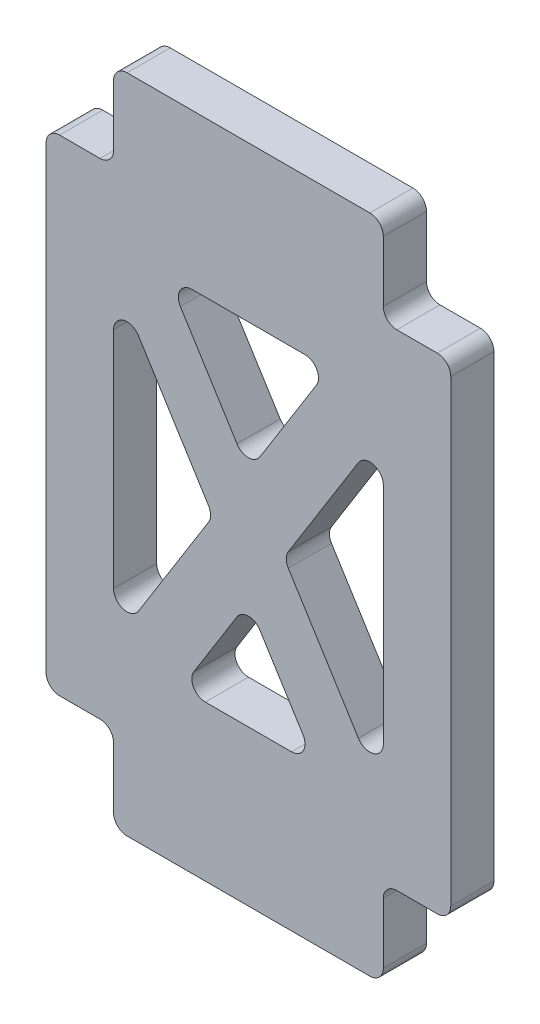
ISO-10303-21;
HEADER;
FILE_DESCRIPTION(('STEP AP214'),'2;1');
FILE_NAME('part.step','',(''),(''),'','','');
FILE_SCHEMA(('AUTOMOTIVE_DESIGN { 1 0 10303 214 1 1 1 1 }'));
ENDSEC;
DATA;
#1=APPLICATION_CONTEXT('core data for automotive mechanical design processes');
#2=APPLICATION_PROTOCOL_DEFINITION('international standard','automotive_design',2000,#1);
#3=PRODUCT_CONTEXT('',#1,'mechanical');
#4=PRODUCT('Part','Part','',(#3));
#5=PRODUCT_RELATED_PRODUCT_CATEGORY('part','',(#4));
#6=PRODUCT_DEFINITION_FORMATION('','',#4);
#7=PRODUCT_DEFINITION_CONTEXT('part definition',#1,'design');
#8=PRODUCT_DEFINITION('design','',#6,#7);
#9=PRODUCT_DEFINITION_SHAPE('','',#8);
#10=(LENGTH_UNIT() NAMED_UNIT(*) SI_UNIT(.MILLI.,.METRE.));
#11=(NAMED_UNIT(*) PLANE_ANGLE_UNIT() SI_UNIT($,.RADIAN.));
#12=(NAMED_UNIT(*) SI_UNIT($,.STERADIAN.) SOLID_ANGLE_UNIT());
#13=UNCERTAINTY_MEASURE_WITH_UNIT(LENGTH_MEASURE(1.E-05),#10,'distance_accuracy_value','');
#14=(GEOMETRIC_REPRESENTATION_CONTEXT(3) GLOBAL_UNCERTAINTY_ASSIGNED_CONTEXT((#13)) GLOBAL_UNIT_ASSIGNED_CONTEXT((#10,
#11,#12)) REPRESENTATION_CONTEXT('',''));
#15=CARTESIAN_POINT('',(0.,0.,0.));
#16=DIRECTION('',(0.,0.,1.));
#17=DIRECTION('',(1.,0.,0.));
#18=AXIS2_PLACEMENT_3D('',#15,#16,#17);
#19=CARTESIAN_POINT('',(15.,-18.,3.2));
#20=DIRECTION('',(0.,1.,0.));
#21=DIRECTION('',(-1.,0.,0.));
#22=AXIS2_PLACEMENT_3D('',#19,#20,#21);
#23=PLANE('',#22);
#24=DIRECTION('',(1.,0.,0.));
#25=VECTOR('',#24,1.);
#26=CARTESIAN_POINT('',(15.,-18.,3.2));
#27=LINE('',#26,#25);
#28=CARTESIAN_POINT('',(-14.,-18.,3.2));
#29=VERTEX_POINT('',#28);
#30=CARTESIAN_POINT('',(-11.,-18.,3.2));
#31=VERTEX_POINT('',#30);
#32=EDGE_CURVE('E343',#29,#31,#27,.T.);
#33=ORIENTED_EDGE('',*,*,#32,.F.);
#34=DIRECTION('',(0.,0.,-1.));
#35=VECTOR('',#34,1.);
#36=CARTESIAN_POINT('',(-14.,-18.,3.2));
#37=LINE('',#36,#35);
#38=CARTESIAN_POINT('',(-14.,-18.,0.));
#39=VERTEX_POINT('',#38);
#40=EDGE_CURVE('E356',#29,#39,#37,.T.);
#41=ORIENTED_EDGE('',*,*,#40,.T.);
#42=DIRECTION('',(1.,0.,0.));
#43=VECTOR('',#42,1.);
#44=CARTESIAN_POINT('',(15.,-18.,0.));
#45=LINE('',#44,#43);
#46=CARTESIAN_POINT('',(-11.,-18.,0.));
#47=VERTEX_POINT('',#46);
#48=EDGE_CURVE('E396',#39,#47,#45,.T.);
#49=ORIENTED_EDGE('',*,*,#48,.T.);
#50=DIRECTION('',(0.,0.,-1.));
#51=VECTOR('',#50,1.);
#52=CARTESIAN_POINT('',(-11.,-18.,3.2));
#53=LINE('',#52,#51);
#54=EDGE_CURVE('E359',#47,#31,#53,.F.);
#55=ORIENTED_EDGE('',*,*,#54,.T.);
#56=EDGE_LOOP('',(#33,#41,#49,#55));
#57=FACE_BOUND('',#56,.T.);
#58=ADVANCED_FACE('F33',(#57),#23,.F.);
#59=CARTESIAN_POINT('',(11.,-18.,3.2));
#60=VERTEX_POINT('',#59);
#61=CARTESIAN_POINT('',(14.,-18.,3.2));
#62=VERTEX_POINT('',#61);
#63=EDGE_CURVE('E361',#60,#62,#27,.T.);
#64=ORIENTED_EDGE('',*,*,#63,.F.);
#65=DIRECTION('',(0.,0.,1.));
#66=VECTOR('',#65,1.);
#67=CARTESIAN_POINT('',(11.,-18.,0.));
#68=LINE('',#67,#66);
#69=CARTESIAN_POINT('',(11.,-18.,0.));
#70=VERTEX_POINT('',#69);
#71=EDGE_CURVE('E464',#60,#70,#68,.F.);
#72=ORIENTED_EDGE('',*,*,#71,.T.);
#73=CARTESIAN_POINT('',(14.,-18.,0.));
#74=VERTEX_POINT('',#73);
#75=EDGE_CURVE('E393',#70,#74,#45,.T.);
#76=ORIENTED_EDGE('',*,*,#75,.T.);
#77=DIRECTION('',(0.,0.,-1.));
#78=VECTOR('',#77,1.);
#79=CARTESIAN_POINT('',(14.,-18.,3.2));
#80=LINE('',#79,#78);
#81=EDGE_CURVE('E462',#74,#62,#80,.F.);
#82=ORIENTED_EDGE('',*,*,#81,.T.);
#83=EDGE_LOOP('',(#64,#72,#76,#82));
#84=FACE_BOUND('',#83,.T.);
#85=ADVANCED_FACE('F775',(#84),#23,.F.);
#86=CARTESIAN_POINT('',(15.,18.,3.2));
#87=DIRECTION('',(0.,-1.,0.));
#88=DIRECTION('',(1.,0.,0.));
#89=AXIS2_PLACEMENT_3D('',#86,#87,#88);
#90=PLANE('',#89);
#91=DIRECTION('',(-1.,0.,0.));
#92=VECTOR('',#91,1.);
#93=CARTESIAN_POINT('',(15.,18.,0.));
#94=LINE('',#93,#92);
#95=CARTESIAN_POINT('',(-11.,18.,0.));
#96=VERTEX_POINT('',#95);
#97=CARTESIAN_POINT('',(-14.,18.,0.));
#98=VERTEX_POINT('',#97);
#99=EDGE_CURVE('E373',#96,#98,#94,.T.);
#100=ORIENTED_EDGE('',*,*,#99,.T.);
#101=DIRECTION('',(0.,0.,-1.));
#102=VECTOR('',#101,1.);
#103=CARTESIAN_POINT('',(-14.,18.,3.2));
#104=LINE('',#103,#102);
#105=CARTESIAN_POINT('',(-14.,18.,3.2));
#106=VERTEX_POINT('',#105);
#107=EDGE_CURVE('E478',#98,#106,#104,.F.);
#108=ORIENTED_EDGE('',*,*,#107,.T.);
#109=DIRECTION('',(-1.,0.,0.));
#110=VECTOR('',#109,1.);
#111=CARTESIAN_POINT('',(15.,18.,3.2));
#112=LINE('',#111,#110);
#113=CARTESIAN_POINT('',(-11.,18.,3.2));
#114=VERTEX_POINT('',#113);
#115=EDGE_CURVE('E423',#114,#106,#112,.T.);
#116=ORIENTED_EDGE('',*,*,#115,.F.);
#117=DIRECTION('',(0.,0.,1.));
#118=VECTOR('',#117,1.);
#119=CARTESIAN_POINT('',(-11.,18.,0.));
#120=LINE('',#119,#118);
#121=EDGE_CURVE('E476',#114,#96,#120,.F.);
#122=ORIENTED_EDGE('',*,*,#121,.T.);
#123=EDGE_LOOP('',(#100,#108,#116,#122));
#124=FACE_BOUND('',#123,.T.);
#125=ADVANCED_FACE('F819',(#124),#90,.F.);
#126=CARTESIAN_POINT('',(14.,18.,3.2));
#127=VERTEX_POINT('',#126);
#128=CARTESIAN_POINT('',(11.,18.,3.2));
#129=VERTEX_POINT('',#128);
#130=EDGE_CURVE('E369',#127,#129,#112,.T.);
#131=ORIENTED_EDGE('',*,*,#130,.F.);
#132=DIRECTION('',(0.,0.,-1.));
#133=VECTOR('',#132,1.);
#134=CARTESIAN_POINT('',(14.,18.,3.2));
#135=LINE('',#134,#133);
#136=CARTESIAN_POINT('',(14.,18.,0.));
#137=VERTEX_POINT('',#136);
#138=EDGE_CURVE('E473',#127,#137,#135,.T.);
#139=ORIENTED_EDGE('',*,*,#138,.T.);
#140=CARTESIAN_POINT('',(11.,18.,0.));
#141=VERTEX_POINT('',#140);
#142=EDGE_CURVE('E377',#137,#141,#94,.T.);
#143=ORIENTED_EDGE('',*,*,#142,.T.);
#144=DIRECTION('',(0.,0.,-1.));
#145=VECTOR('',#144,1.);
#146=CARTESIAN_POINT('',(11.,18.,3.2));
#147=LINE('',#146,#145);
#148=EDGE_CURVE('E471',#141,#129,#147,.F.);
#149=ORIENTED_EDGE('',*,*,#148,.T.);
#150=EDGE_LOOP('',(#131,#139,#143,#149));
#151=FACE_BOUND('',#150,.T.);
#152=ADVANCED_FACE('F795',(#151),#90,.F.);
#153=CARTESIAN_POINT('',(-15.,-18.,3.2));
#154=DIRECTION('',(1.,0.,0.));
#155=DIRECTION('',(0.,0.,-1.));
#156=AXIS2_PLACEMENT_3D('',#153,#154,#155);
#157=PLANE('',#156);
#158=DIRECTION('',(0.,-1.,0.));
#159=VECTOR('',#158,1.);
#160=CARTESIAN_POINT('',(-15.,-18.,0.));
#161=LINE('',#160,#159);
#162=CARTESIAN_POINT('',(-15.,17.,0.));
#163=VERTEX_POINT('',#162);
#164=CARTESIAN_POINT('',(-15.,-17.,0.));
#165=VERTEX_POINT('',#164);
#166=EDGE_CURVE('E397',#163,#165,#161,.T.);
#167=ORIENTED_EDGE('',*,*,#166,.T.);
#168=DIRECTION('',(0.,0.,-1.));
#169=VECTOR('',#168,1.);
#170=CARTESIAN_POINT('',(-15.,-17.,3.2));
#171=LINE('',#170,#169);
#172=CARTESIAN_POINT('',(-15.,-17.,3.2));
#173=VERTEX_POINT('',#172);
#174=EDGE_CURVE('E436',#165,#173,#171,.F.);
#175=ORIENTED_EDGE('',*,*,#174,.T.);
#176=DIRECTION('',(0.,-1.,0.));
#177=VECTOR('',#176,1.);
#178=CARTESIAN_POINT('',(-15.,-18.,3.2));
#179=LINE('',#178,#177);
#180=CARTESIAN_POINT('',(-15.,17.,3.2));
#181=VERTEX_POINT('',#180);
#182=EDGE_CURVE('E346',#181,#173,#179,.T.);
#183=ORIENTED_EDGE('',*,*,#182,.F.);
#184=DIRECTION('',(0.,0.,-1.));
#185=VECTOR('',#184,1.);
#186=CARTESIAN_POINT('',(-15.,17.,3.2));
#187=LINE('',#186,#185);
#188=EDGE_CURVE('E718',#181,#163,#187,.T.);
#189=ORIENTED_EDGE('',*,*,#188,.T.);
#190=EDGE_LOOP('',(#167,#175,#183,#189));
#191=FACE_BOUND('',#190,.T.);
#192=ADVANCED_FACE('F716',(#191),#157,.F.);
#193=CARTESIAN_POINT('',(15.,-18.,3.2));
#194=DIRECTION('',(-1.,0.,0.));
#195=DIRECTION('',(0.,0.,1.));
#196=AXIS2_PLACEMENT_3D('',#193,#194,#195);
#197=PLANE('',#196);
#198=DIRECTION('',(0.,1.,0.));
#199=VECTOR('',#198,1.);
#200=CARTESIAN_POINT('',(15.,-18.,3.2));
#201=LINE('',#200,#199);
#202=CARTESIAN_POINT('',(15.,-17.,3.2));
#203=VERTEX_POINT('',#202);
#204=CARTESIAN_POINT('',(15.,17.,3.2));
#205=VERTEX_POINT('',#204);
#206=EDGE_CURVE('E360',#203,#205,#201,.T.);
#207=ORIENTED_EDGE('',*,*,#206,.F.);
#208=DIRECTION('',(0.,0.,-1.));
#209=VECTOR('',#208,1.);
#210=CARTESIAN_POINT('',(15.,-17.,3.2));
#211=LINE('',#210,#209);
#212=CARTESIAN_POINT('',(15.,-17.,0.));
#213=VERTEX_POINT('',#212);
#214=EDGE_CURVE('E468',#203,#213,#211,.T.);
#215=ORIENTED_EDGE('',*,*,#214,.T.);
#216=DIRECTION('',(0.,1.,0.));
#217=VECTOR('',#216,1.);
#218=CARTESIAN_POINT('',(15.,-18.,0.));
#219=LINE('',#218,#217);
#220=CARTESIAN_POINT('',(15.,17.,0.));
#221=VERTEX_POINT('',#220);
#222=EDGE_CURVE('E378',#213,#221,#219,.T.);
#223=ORIENTED_EDGE('',*,*,#222,.T.);
#224=DIRECTION('',(0.,0.,-1.));
#225=VECTOR('',#224,1.);
#226=CARTESIAN_POINT('',(15.,17.,3.2));
#227=LINE('',#226,#225);
#228=EDGE_CURVE('E466',#221,#205,#227,.F.);
#229=ORIENTED_EDGE('',*,*,#228,.T.);
#230=EDGE_LOOP('',(#207,#215,#223,#229));
#231=FACE_BOUND('',#230,.T.);
#232=ADVANCED_FACE('F785',(#231),#197,.F.);
#233=CARTESIAN_POINT('',(0.,0.,3.2));
#234=DIRECTION('',(0.,0.,1.));
#235=DIRECTION('',(1.,0.,0.));
#236=AXIS2_PLACEMENT_3D('',#233,#234,#235);
#237=PLANE('',#236);
#238=DIRECTION('',(-0.529998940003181,-0.847998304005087,0.));
#239=VECTOR('',#238,1.);
#240=CARTESIAN_POINT('',(2.24719101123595,-1.40449438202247,3.2));
#241=LINE('',#240,#239);
#242=CARTESIAN_POINT('',(-0.847998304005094,-6.35679728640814,3.2));
#243=VERTEX_POINT('',#242);
#244=CARTESIAN_POINT('',(-4.04375066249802,-11.4700010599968,3.2));
#245=VERTEX_POINT('',#244);
#246=EDGE_CURVE('E1160',#243,#245,#241,.T.);
#247=ORIENTED_EDGE('',*,*,#246,.F.);
#248=CARTESIAN_POINT('',(0.,-6.88679622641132,3.2));
#249=DIRECTION('',(0.,0.,1.));
#250=DIRECTION('',(1.,0.,0.));
#251=AXIS2_PLACEMENT_3D('',#248,#249,#250);
#252=CIRCLE('',#251,1.);
#253=CARTESIAN_POINT('',(0.847998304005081,-6.35679728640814,3.2));
#254=VERTEX_POINT('',#253);
#255=EDGE_CURVE('E611',#243,#254,#252,.F.);
#256=ORIENTED_EDGE('',*,*,#255,.T.);
#257=DIRECTION('',(-0.529998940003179,0.847998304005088,0.));
#258=VECTOR('',#257,1.);
#259=CARTESIAN_POINT('',(-2.24719101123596,-1.40449438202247,3.2));
#260=LINE('',#259,#258);
#261=CARTESIAN_POINT('',(4.04375066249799,-11.4700010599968,3.2));
#262=VERTEX_POINT('',#261);
#263=EDGE_CURVE('E1157',#262,#254,#260,.T.);
#264=ORIENTED_EDGE('',*,*,#263,.F.);
#265=CARTESIAN_POINT('',(3.19575235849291,-12.,3.2));
#266=DIRECTION('',(0.,0.,1.));
#267=DIRECTION('',(1.,0.,0.));
#268=AXIS2_PLACEMENT_3D('',#265,#266,#267);
#269=CIRCLE('',#268,1.);
#270=CARTESIAN_POINT('',(3.19575235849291,-13.,3.2));
#271=VERTEX_POINT('',#270);
#272=EDGE_CURVE('E608',#262,#271,#269,.F.);
#273=ORIENTED_EDGE('',*,*,#272,.T.);
#274=DIRECTION('',(1.,0.,0.));
#275=VECTOR('',#274,1.);
#276=CARTESIAN_POINT('',(0.,-13.,3.2));
#277=LINE('',#276,#275);
#278=CARTESIAN_POINT('',(-3.19575235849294,-13.,3.2));
#279=VERTEX_POINT('',#278);
#280=EDGE_CURVE('E1162',#279,#271,#277,.T.);
#281=ORIENTED_EDGE('',*,*,#280,.F.);
#282=CARTESIAN_POINT('',(-3.19575235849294,-12.,3.2));
#283=DIRECTION('',(0.,0.,1.));
#284=DIRECTION('',(1.,0.,0.));
#285=AXIS2_PLACEMENT_3D('',#282,#283,#284);
#286=CIRCLE('',#285,1.);
#287=EDGE_CURVE('E605',#279,#245,#286,.F.);
#288=ORIENTED_EDGE('',*,*,#287,.T.);
#289=EDGE_LOOP('',(#247,#256,#264,#273,#281,#288));
#290=FACE_BOUND('',#289,.T.);
#291=DIRECTION('',(0.52999894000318,0.847998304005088,0.));
#292=VECTOR('',#291,1.);
#293=CARTESIAN_POINT('',(-1.52808988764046,0.955056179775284,3.2));
#294=LINE('',#293,#292);
#295=CARTESIAN_POINT('',(0.847998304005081,4.75679728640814,3.2));
#296=VERTEX_POINT('',#295);
#297=CARTESIAN_POINT('',(5.04375066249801,11.4700010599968,3.2));
#298=VERTEX_POINT('',#297);
#299=EDGE_CURVE('E638',#296,#298,#294,.T.);
#300=ORIENTED_EDGE('',*,*,#299,.F.);
#301=CARTESIAN_POINT('',(0.,5.28679622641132,3.2));
#302=DIRECTION('',(0.,0.,1.));
#303=DIRECTION('',(1.,0.,0.));
#304=AXIS2_PLACEMENT_3D('',#301,#302,#303);
#305=CIRCLE('',#304,1.);
#306=CARTESIAN_POINT('',(-0.847998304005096,4.75679728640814,3.2));
#307=VERTEX_POINT('',#306);
#308=EDGE_CURVE('E601',#296,#307,#305,.F.);
#309=ORIENTED_EDGE('',*,*,#308,.T.);
#310=DIRECTION('',(0.52999894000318,-0.847998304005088,0.));
#311=VECTOR('',#310,1.);
#312=CARTESIAN_POINT('',(1.52808988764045,0.955056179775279,3.2));
#313=LINE('',#312,#311);
#314=CARTESIAN_POINT('',(-5.04375066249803,11.4700010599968,3.2));
#315=VERTEX_POINT('',#314);
#316=EDGE_CURVE('E630',#315,#307,#313,.T.);
#317=ORIENTED_EDGE('',*,*,#316,.F.);
#318=CARTESIAN_POINT('',(-4.19575235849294,12.,3.2));
#319=DIRECTION('',(0.,0.,1.));
#320=DIRECTION('',(1.,0.,0.));
#321=AXIS2_PLACEMENT_3D('',#318,#319,#320);
#322=CIRCLE('',#321,1.);
#323=CARTESIAN_POINT('',(-4.19575235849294,13.,3.2));
#324=VERTEX_POINT('',#323);
#325=EDGE_CURVE('E597',#315,#324,#322,.F.);
#326=ORIENTED_EDGE('',*,*,#325,.T.);
#327=DIRECTION('',(-1.,0.,0.));
#328=VECTOR('',#327,1.);
#329=CARTESIAN_POINT('',(0.,13.,3.2));
#330=LINE('',#329,#328);
#331=CARTESIAN_POINT('',(4.19575235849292,13.,3.2));
#332=VERTEX_POINT('',#331);
#333=EDGE_CURVE('E640',#332,#324,#330,.T.);
#334=ORIENTED_EDGE('',*,*,#333,.F.);
#335=CARTESIAN_POINT('',(4.19575235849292,12.,3.2));
#336=DIRECTION('',(0.,0.,1.));
#337=DIRECTION('',(1.,0.,0.));
#338=AXIS2_PLACEMENT_3D('',#335,#336,#337);
#339=CIRCLE('',#338,1.);
#340=EDGE_CURVE('E11',#332,#298,#339,.F.);
#341=ORIENTED_EDGE('',*,*,#340,.T.);
#342=EDGE_LOOP('',(#300,#309,#317,#326,#334,#341));
#343=FACE_BOUND('',#342,.T.);
#344=DIRECTION('',(0.,-1.,0.));
#345=VECTOR('',#344,1.);
#346=CARTESIAN_POINT('',(-10.,0.,3.2));
#347=LINE('',#346,#345);
#348=CARTESIAN_POINT('',(-10.,7.51320377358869,3.2));
#349=VERTEX_POINT('',#348);
#350=CARTESIAN_POINT('',(-10.,-9.11320377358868,3.2));
#351=VERTEX_POINT('',#350);
#352=EDGE_CURVE('E663',#349,#351,#347,.T.);
#353=ORIENTED_EDGE('',*,*,#352,.F.);
#354=CARTESIAN_POINT('',(-9.00000000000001,7.51320377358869,3.2));
#355=DIRECTION('',(0.,0.,1.));
#356=DIRECTION('',(1.,0.,0.));
#357=AXIS2_PLACEMENT_3D('',#354,#355,#356);
#358=CIRCLE('',#357,1.);
#359=CARTESIAN_POINT('',(-8.15200169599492,8.04320271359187,3.2));
#360=VERTEX_POINT('',#359);
#361=EDGE_CURVE('E593',#349,#360,#358,.F.);
#362=ORIENTED_EDGE('',*,*,#361,.T.);
#363=DIRECTION('',(-0.52999894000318,0.847998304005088,0.));
#364=VECTOR('',#363,1.);
#365=CARTESIAN_POINT('',(-2.24719101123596,-1.40449438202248,3.2));
#366=LINE('',#365,#364);
#367=CARTESIAN_POINT('',(-2.956249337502,-0.270001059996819,3.2));
#368=VERTEX_POINT('',#367);
#369=EDGE_CURVE('E657',#368,#360,#366,.T.);
#370=ORIENTED_EDGE('',*,*,#369,.F.);
#371=CARTESIAN_POINT('',(-3.80424764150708,-0.799999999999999,3.2));
#372=DIRECTION('',(0.,0.,1.));
#373=DIRECTION('',(1.,0.,0.));
#374=AXIS2_PLACEMENT_3D('',#371,#372,#373);
#375=CIRCLE('',#374,1.);
#376=CARTESIAN_POINT('',(-2.956249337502,-1.32999894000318,3.2));
#377=VERTEX_POINT('',#376);
#378=EDGE_CURVE('E589',#368,#377,#375,.F.);
#379=ORIENTED_EDGE('',*,*,#378,.T.);
#380=DIRECTION('',(0.52999894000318,0.847998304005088,0.));
#381=VECTOR('',#380,1.);
#382=CARTESIAN_POINT('',(-1.52808988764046,0.955056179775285,3.2));
#383=LINE('',#382,#381);
#384=CARTESIAN_POINT('',(-8.15200169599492,-9.64320271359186,3.2));
#385=VERTEX_POINT('',#384);
#386=EDGE_CURVE('E660',#385,#377,#383,.T.);
#387=ORIENTED_EDGE('',*,*,#386,.F.);
#388=CARTESIAN_POINT('',(-9.00000000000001,-9.11320377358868,3.2));
#389=DIRECTION('',(0.,0.,1.));
#390=DIRECTION('',(1.,0.,0.));
#391=AXIS2_PLACEMENT_3D('',#388,#389,#390);
#392=CIRCLE('',#391,1.);
#393=EDGE_CURVE('E585',#385,#351,#392,.F.);
#394=ORIENTED_EDGE('',*,*,#393,.T.);
#395=EDGE_LOOP('',(#353,#362,#370,#379,#387,#394));
#396=FACE_BOUND('',#395,.T.);
#397=DIRECTION('',(0.52999894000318,-0.847998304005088,0.));
#398=VECTOR('',#397,1.);
#399=CARTESIAN_POINT('',(1.52808988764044,0.955056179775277,3.2));
#400=LINE('',#399,#398);
#401=CARTESIAN_POINT('',(2.95624933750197,-1.32999894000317,3.2));
#402=VERTEX_POINT('',#401);
#403=CARTESIAN_POINT('',(8.1520016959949,-9.64320271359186,3.2));
#404=VERTEX_POINT('',#403);
#405=EDGE_CURVE('E681',#402,#404,#400,.T.);
#406=ORIENTED_EDGE('',*,*,#405,.F.);
#407=CARTESIAN_POINT('',(3.80424764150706,-0.799999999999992,3.2));
#408=DIRECTION('',(0.,0.,1.));
#409=DIRECTION('',(1.,0.,0.));
#410=AXIS2_PLACEMENT_3D('',#407,#408,#409);
#411=CIRCLE('',#410,1.);
#412=CARTESIAN_POINT('',(2.95624933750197,-0.270001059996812,3.2));
#413=VERTEX_POINT('',#412);
#414=EDGE_CURVE('E581',#402,#413,#411,.F.);
#415=ORIENTED_EDGE('',*,*,#414,.T.);
#416=DIRECTION('',(-0.52999894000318,-0.847998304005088,0.));
#417=VECTOR('',#416,1.);
#418=CARTESIAN_POINT('',(2.24719101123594,-1.40449438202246,3.2));
#419=LINE('',#418,#417);
#420=CARTESIAN_POINT('',(8.1520016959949,8.04320271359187,3.2));
#421=VERTEX_POINT('',#420);
#422=EDGE_CURVE('E675',#421,#413,#419,.T.);
#423=ORIENTED_EDGE('',*,*,#422,.F.);
#424=CARTESIAN_POINT('',(8.99999999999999,7.51320377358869,3.2));
#425=DIRECTION('',(0.,0.,1.));
#426=DIRECTION('',(1.,0.,0.));
#427=AXIS2_PLACEMENT_3D('',#424,#425,#426);
#428=CIRCLE('',#427,1.);
#429=CARTESIAN_POINT('',(9.99999999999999,7.51320377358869,3.2));
#430=VERTEX_POINT('',#429);
#431=EDGE_CURVE('E577',#421,#430,#428,.F.);
#432=ORIENTED_EDGE('',*,*,#431,.T.);
#433=DIRECTION('',(0.,1.,0.));
#434=VECTOR('',#433,1.);
#435=CARTESIAN_POINT('',(9.99999999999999,0.,3.2));
#436=LINE('',#435,#434);
#437=CARTESIAN_POINT('',(9.99999999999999,-9.11320377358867,3.2));
#438=VERTEX_POINT('',#437);
#439=EDGE_CURVE('E678',#438,#430,#436,.T.);
#440=ORIENTED_EDGE('',*,*,#439,.F.);
#441=CARTESIAN_POINT('',(8.99999999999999,-9.11320377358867,3.2));
#442=DIRECTION('',(0.,0.,1.));
#443=DIRECTION('',(1.,0.,0.));
#444=AXIS2_PLACEMENT_3D('',#441,#442,#443);
#445=CIRCLE('',#444,1.);
#446=EDGE_CURVE('E573',#438,#404,#445,.F.);
#447=ORIENTED_EDGE('',*,*,#446,.T.);
#448=EDGE_LOOP('',(#406,#415,#423,#432,#440,#447));
#449=FACE_BOUND('',#448,.T.);
#450=ORIENTED_EDGE('',*,*,#182,.T.);
#451=CARTESIAN_POINT('',(-14.,-17.,3.2));
#452=DIRECTION('',(0.,0.,1.));
#453=DIRECTION('',(1.,0.,0.));
#454=AXIS2_PLACEMENT_3D('',#451,#452,#453);
#455=CIRCLE('',#454,1.);
#456=EDGE_CURVE('E340',#173,#29,#455,.T.);
#457=ORIENTED_EDGE('',*,*,#456,.T.);
#458=ORIENTED_EDGE('',*,*,#32,.T.);
#459=CARTESIAN_POINT('',(-11.,-19.,3.2));
#460=DIRECTION('',(0.,0.,1.));
#461=DIRECTION('',(1.,0.,0.));
#462=AXIS2_PLACEMENT_3D('',#459,#460,#461);
#463=CIRCLE('',#462,1.);
#464=CARTESIAN_POINT('',(-10.,-19.,3.2));
#465=VERTEX_POINT('',#464);
#466=EDGE_CURVE('E498',#31,#465,#463,.F.);
#467=ORIENTED_EDGE('',*,*,#466,.T.);
#468=DIRECTION('',(0.,1.,0.));
#469=VECTOR('',#468,1.);
#470=CARTESIAN_POINT('',(-10.,-24.5,3.2));
#471=LINE('',#470,#469);
#472=CARTESIAN_POINT('',(-10.,-23.5,3.2));
#473=VERTEX_POINT('',#472);
#474=EDGE_CURVE('E690',#473,#465,#471,.T.);
#475=ORIENTED_EDGE('',*,*,#474,.F.);
#476=CARTESIAN_POINT('',(-9.,-23.5,3.2));
#477=DIRECTION('',(0.,0.,1.));
#478=DIRECTION('',(1.,0.,0.));
#479=AXIS2_PLACEMENT_3D('',#476,#477,#478);
#480=CIRCLE('',#479,1.);
#481=CARTESIAN_POINT('',(-9.,-24.5,3.2));
#482=VERTEX_POINT('',#481);
#483=EDGE_CURVE('E351',#473,#482,#480,.T.);
#484=ORIENTED_EDGE('',*,*,#483,.T.);
#485=DIRECTION('',(-1.,0.,0.));
#486=VECTOR('',#485,1.);
#487=CARTESIAN_POINT('',(-10.,-24.5,3.2));
#488=LINE('',#487,#486);
#489=CARTESIAN_POINT('',(9.,-24.5,3.2));
#490=VERTEX_POINT('',#489);
#491=EDGE_CURVE('E687',#490,#482,#488,.T.);
#492=ORIENTED_EDGE('',*,*,#491,.F.);
#493=CARTESIAN_POINT('',(9.,-23.5,3.2));
#494=DIRECTION('',(0.,0.,1.));
#495=DIRECTION('',(1.,0.,0.));
#496=AXIS2_PLACEMENT_3D('',#493,#494,#495);
#497=CIRCLE('',#496,1.);
#498=CARTESIAN_POINT('',(10.,-23.5,3.2));
#499=VERTEX_POINT('',#498);
#500=EDGE_CURVE('E444',#490,#499,#497,.T.);
#501=ORIENTED_EDGE('',*,*,#500,.T.);
#502=DIRECTION('',(0.,1.,0.));
#503=VECTOR('',#502,1.);
#504=CARTESIAN_POINT('',(10.,-24.5,3.2));
#505=LINE('',#504,#503);
#506=CARTESIAN_POINT('',(10.,-19.,3.2));
#507=VERTEX_POINT('',#506);
#508=EDGE_CURVE('E418',#499,#507,#505,.T.);
#509=ORIENTED_EDGE('',*,*,#508,.T.);
#510=CARTESIAN_POINT('',(11.,-19.,3.2));
#511=DIRECTION('',(0.,0.,1.));
#512=DIRECTION('',(1.,0.,0.));
#513=AXIS2_PLACEMENT_3D('',#510,#511,#512);
#514=CIRCLE('',#513,1.);
#515=EDGE_CURVE('E500',#507,#60,#514,.F.);
#516=ORIENTED_EDGE('',*,*,#515,.T.);
#517=ORIENTED_EDGE('',*,*,#63,.T.);
#518=CARTESIAN_POINT('',(14.,-17.,3.2));
#519=DIRECTION('',(0.,0.,1.));
#520=DIRECTION('',(1.,0.,0.));
#521=AXIS2_PLACEMENT_3D('',#518,#519,#520);
#522=CIRCLE('',#521,1.);
#523=EDGE_CURVE('E442',#62,#203,#522,.T.);
#524=ORIENTED_EDGE('',*,*,#523,.T.);
#525=ORIENTED_EDGE('',*,*,#206,.T.);
#526=CARTESIAN_POINT('',(14.,17.,3.2));
#527=DIRECTION('',(0.,0.,1.));
#528=DIRECTION('',(1.,0.,0.));
#529=AXIS2_PLACEMENT_3D('',#526,#527,#528);
#530=CIRCLE('',#529,1.);
#531=EDGE_CURVE('E440',#205,#127,#530,.T.);
#532=ORIENTED_EDGE('',*,*,#531,.T.);
#533=ORIENTED_EDGE('',*,*,#130,.T.);
#534=CARTESIAN_POINT('',(11.,19.,3.2));
#535=DIRECTION('',(0.,0.,1.));
#536=DIRECTION('',(1.,0.,0.));
#537=AXIS2_PLACEMENT_3D('',#534,#535,#536);
#538=CIRCLE('',#537,1.);
#539=CARTESIAN_POINT('',(9.99999999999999,19.,3.2));
#540=VERTEX_POINT('',#539);
#541=EDGE_CURVE('E510',#129,#540,#538,.F.);
#542=ORIENTED_EDGE('',*,*,#541,.T.);
#543=DIRECTION('',(0.,-1.,0.));
#544=VECTOR('',#543,1.);
#545=CARTESIAN_POINT('',(9.99999999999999,24.5,3.2));
#546=LINE('',#545,#544);
#547=CARTESIAN_POINT('',(9.99999999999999,23.5,3.2));
#548=VERTEX_POINT('',#547);
#549=EDGE_CURVE('E424',#548,#540,#546,.T.);
#550=ORIENTED_EDGE('',*,*,#549,.F.);
#551=CARTESIAN_POINT('',(8.99999999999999,23.5,3.2));
#552=DIRECTION('',(0.,0.,1.));
#553=DIRECTION('',(1.,0.,0.));
#554=AXIS2_PLACEMENT_3D('',#551,#552,#553);
#555=CIRCLE('',#554,1.);
#556=CARTESIAN_POINT('',(8.99999999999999,24.5,3.2));
#557=VERTEX_POINT('',#556);
#558=EDGE_CURVE('E433',#548,#557,#555,.T.);
#559=ORIENTED_EDGE('',*,*,#558,.T.);
#560=DIRECTION('',(1.,0.,0.));
#561=VECTOR('',#560,1.);
#562=CARTESIAN_POINT('',(-10.,24.5,3.2));
#563=LINE('',#562,#561);
#564=CARTESIAN_POINT('',(-9.00000000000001,24.5,3.2));
#565=VERTEX_POINT('',#564);
#566=EDGE_CURVE('E691',#565,#557,#563,.T.);
#567=ORIENTED_EDGE('',*,*,#566,.F.);
#568=CARTESIAN_POINT('',(-9.00000000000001,23.5,3.2));
#569=DIRECTION('',(0.,0.,1.));
#570=DIRECTION('',(1.,0.,0.));
#571=AXIS2_PLACEMENT_3D('',#568,#569,#570);
#572=CIRCLE('',#571,1.);
#573=CARTESIAN_POINT('',(-10.,23.5,3.2));
#574=VERTEX_POINT('',#573);
#575=EDGE_CURVE('E435',#565,#574,#572,.T.);
#576=ORIENTED_EDGE('',*,*,#575,.T.);
#577=DIRECTION('',(0.,-1.,0.));
#578=VECTOR('',#577,1.);
#579=CARTESIAN_POINT('',(-10.,24.5,3.2));
#580=LINE('',#579,#578);
#581=CARTESIAN_POINT('',(-10.,19.,3.2));
#582=VERTEX_POINT('',#581);
#583=EDGE_CURVE('E431',#574,#582,#580,.T.);
#584=ORIENTED_EDGE('',*,*,#583,.T.);
#585=CARTESIAN_POINT('',(-11.,19.,3.2));
#586=DIRECTION('',(0.,0.,1.));
#587=DIRECTION('',(1.,0.,0.));
#588=AXIS2_PLACEMENT_3D('',#585,#586,#587);
#589=CIRCLE('',#588,1.);
#590=EDGE_CURVE('E504',#582,#114,#589,.F.);
#591=ORIENTED_EDGE('',*,*,#590,.T.);
#592=ORIENTED_EDGE('',*,*,#115,.T.);
#593=CARTESIAN_POINT('',(-14.,17.,3.2));
#594=DIRECTION('',(0.,0.,1.));
#595=DIRECTION('',(1.,0.,0.));
#596=AXIS2_PLACEMENT_3D('',#593,#594,#595);
#597=CIRCLE('',#596,1.);
#598=EDGE_CURVE('E438',#106,#181,#597,.T.);
#599=ORIENTED_EDGE('',*,*,#598,.T.);
#600=EDGE_LOOP('',(#450,#457,#458,#467,#475,#484,#492,#501,#509,#516,#517,#524,#525,#532,#533,
#542,#550,#559,#567,#576,#584,#591,#592,#599));
#601=FACE_BOUND('',#600,.T.);
#602=ADVANCED_FACE('F342',(#290,#343,#396,#449,#601),#237,.T.);
#603=CARTESIAN_POINT('',(0.,0.,0.));
#604=DIRECTION('',(0.,0.,1.));
#605=DIRECTION('',(1.,0.,0.));
#606=AXIS2_PLACEMENT_3D('',#603,#604,#605);
#607=PLANE('',#606);
#608=DIRECTION('',(0.529998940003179,-0.847998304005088,0.));
#609=VECTOR('',#608,1.);
#610=CARTESIAN_POINT('',(0.,-5.,0.));
#611=LINE('',#610,#609);
#612=CARTESIAN_POINT('',(0.847998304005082,-6.35679728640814,0.));
#613=VERTEX_POINT('',#612);
#614=CARTESIAN_POINT('',(4.04375066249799,-11.4700010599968,0.));
#615=VERTEX_POINT('',#614);
#616=EDGE_CURVE('E1168',#613,#615,#611,.T.);
#617=ORIENTED_EDGE('',*,*,#616,.F.);
#618=CARTESIAN_POINT('',(0.,-6.88679622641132,0.));
#619=DIRECTION('',(0.,0.,1.));
#620=DIRECTION('',(1.,0.,0.));
#621=AXIS2_PLACEMENT_3D('',#618,#619,#620);
#622=CIRCLE('',#621,1.);
#623=CARTESIAN_POINT('',(-0.847998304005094,-6.35679728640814,0.));
#624=VERTEX_POINT('',#623);
#625=EDGE_CURVE('E56',#613,#624,#622,.T.);
#626=ORIENTED_EDGE('',*,*,#625,.T.);
#627=DIRECTION('',(0.529998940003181,0.847998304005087,0.));
#628=VECTOR('',#627,1.);
#629=CARTESIAN_POINT('',(0.,-5.,0.));
#630=LINE('',#629,#628);
#631=CARTESIAN_POINT('',(-4.04375066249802,-11.4700010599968,0.));
#632=VERTEX_POINT('',#631);
#633=EDGE_CURVE('E1185',#632,#624,#630,.T.);
#634=ORIENTED_EDGE('',*,*,#633,.F.);
#635=CARTESIAN_POINT('',(-3.19575235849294,-12.,0.));
#636=DIRECTION('',(0.,0.,1.));
#637=DIRECTION('',(1.,0.,0.));
#638=AXIS2_PLACEMENT_3D('',#635,#636,#637);
#639=CIRCLE('',#638,1.);
#640=CARTESIAN_POINT('',(-3.19575235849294,-13.,0.));
#641=VERTEX_POINT('',#640);
#642=EDGE_CURVE('E603',#632,#641,#639,.T.);
#643=ORIENTED_EDGE('',*,*,#642,.T.);
#644=DIRECTION('',(-1.,0.,0.));
#645=VECTOR('',#644,1.);
#646=CARTESIAN_POINT('',(4.99999999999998,-13.,0.));
#647=LINE('',#646,#645);
#648=CARTESIAN_POINT('',(3.19575235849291,-13.,0.));
#649=VERTEX_POINT('',#648);
#650=EDGE_CURVE('E1163',#649,#641,#647,.T.);
#651=ORIENTED_EDGE('',*,*,#650,.F.);
#652=CARTESIAN_POINT('',(3.19575235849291,-12.,0.));
#653=DIRECTION('',(0.,0.,1.));
#654=DIRECTION('',(1.,0.,0.));
#655=AXIS2_PLACEMENT_3D('',#652,#653,#654);
#656=CIRCLE('',#655,1.);
#657=EDGE_CURVE('E48',#649,#615,#656,.T.);
#658=ORIENTED_EDGE('',*,*,#657,.T.);
#659=EDGE_LOOP('',(#617,#626,#634,#643,#651,#658));
#660=FACE_BOUND('',#659,.T.);
#661=DIRECTION('',(-0.52999894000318,0.847998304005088,0.));
#662=VECTOR('',#661,1.);
#663=CARTESIAN_POINT('',(-6.00000000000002,13.,0.));
#664=LINE('',#663,#662);
#665=CARTESIAN_POINT('',(-0.847998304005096,4.75679728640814,0.));
#666=VERTEX_POINT('',#665);
#667=CARTESIAN_POINT('',(-5.04375066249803,11.4700010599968,0.));
#668=VERTEX_POINT('',#667);
#669=EDGE_CURVE('E631',#666,#668,#664,.T.);
#670=ORIENTED_EDGE('',*,*,#669,.F.);
#671=CARTESIAN_POINT('',(0.,5.28679622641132,0.));
#672=DIRECTION('',(0.,0.,1.));
#673=DIRECTION('',(1.,0.,0.));
#674=AXIS2_PLACEMENT_3D('',#671,#672,#673);
#675=CIRCLE('',#674,1.);
#676=CARTESIAN_POINT('',(0.847998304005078,4.75679728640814,0.));
#677=VERTEX_POINT('',#676);
#678=EDGE_CURVE('E599',#666,#677,#675,.T.);
#679=ORIENTED_EDGE('',*,*,#678,.T.);
#680=DIRECTION('',(-0.52999894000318,-0.847998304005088,0.));
#681=VECTOR('',#680,1.);
#682=CARTESIAN_POINT('',(6.,13.,0.));
#683=LINE('',#682,#681);
#684=CARTESIAN_POINT('',(5.04375066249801,11.4700010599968,0.));
#685=VERTEX_POINT('',#684);
#686=EDGE_CURVE('E621',#685,#677,#683,.T.);
#687=ORIENTED_EDGE('',*,*,#686,.F.);
#688=CARTESIAN_POINT('',(4.19575235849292,12.,0.));
#689=DIRECTION('',(0.,0.,1.));
#690=DIRECTION('',(1.,0.,0.));
#691=AXIS2_PLACEMENT_3D('',#688,#689,#690);
#692=CIRCLE('',#691,1.);
#693=CARTESIAN_POINT('',(4.19575235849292,13.,0.));
#694=VERTEX_POINT('',#693);
#695=EDGE_CURVE('E41',#685,#694,#692,.T.);
#696=ORIENTED_EDGE('',*,*,#695,.T.);
#697=DIRECTION('',(1.,0.,0.));
#698=VECTOR('',#697,1.);
#699=CARTESIAN_POINT('',(6.,13.,0.));
#700=LINE('',#699,#698);
#701=CARTESIAN_POINT('',(-4.19575235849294,13.,0.));
#702=VERTEX_POINT('',#701);
#703=EDGE_CURVE('E619',#702,#694,#700,.T.);
#704=ORIENTED_EDGE('',*,*,#703,.F.);
#705=CARTESIAN_POINT('',(-4.19575235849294,12.,0.));
#706=DIRECTION('',(0.,0.,1.));
#707=DIRECTION('',(1.,0.,0.));
#708=AXIS2_PLACEMENT_3D('',#705,#706,#707);
#709=CIRCLE('',#708,1.);
#710=EDGE_CURVE('E595',#702,#668,#709,.T.);
#711=ORIENTED_EDGE('',*,*,#710,.T.);
#712=EDGE_LOOP('',(#670,#679,#687,#696,#704,#711));
#713=FACE_BOUND('',#712,.T.);
#714=DIRECTION('',(0.52999894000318,-0.847998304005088,0.));
#715=VECTOR('',#714,1.);
#716=CARTESIAN_POINT('',(-10.,11.,0.));
#717=LINE('',#716,#715);
#718=CARTESIAN_POINT('',(-8.15200169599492,8.04320271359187,0.));
#719=VERTEX_POINT('',#718);
#720=CARTESIAN_POINT('',(-2.956249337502,-0.270001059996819,0.));
#721=VERTEX_POINT('',#720);
#722=EDGE_CURVE('E647',#719,#721,#717,.T.);
#723=ORIENTED_EDGE('',*,*,#722,.F.);
#724=CARTESIAN_POINT('',(-9.00000000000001,7.51320377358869,0.));
#725=DIRECTION('',(0.,0.,1.));
#726=DIRECTION('',(1.,0.,0.));
#727=AXIS2_PLACEMENT_3D('',#724,#725,#726);
#728=CIRCLE('',#727,1.);
#729=CARTESIAN_POINT('',(-10.,7.51320377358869,0.));
#730=VERTEX_POINT('',#729);
#731=EDGE_CURVE('E591',#719,#730,#728,.T.);
#732=ORIENTED_EDGE('',*,*,#731,.T.);
#733=DIRECTION('',(0.,1.,0.));
#734=VECTOR('',#733,1.);
#735=CARTESIAN_POINT('',(-10.,-12.6,0.));
#736=LINE('',#735,#734);
#737=CARTESIAN_POINT('',(-10.,-9.11320377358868,0.));
#738=VERTEX_POINT('',#737);
#739=EDGE_CURVE('E644',#738,#730,#736,.T.);
#740=ORIENTED_EDGE('',*,*,#739,.F.);
#741=CARTESIAN_POINT('',(-9.00000000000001,-9.11320377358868,0.));
#742=DIRECTION('',(0.,0.,1.));
#743=DIRECTION('',(1.,0.,0.));
#744=AXIS2_PLACEMENT_3D('',#741,#742,#743);
#745=CIRCLE('',#744,1.);
#746=CARTESIAN_POINT('',(-8.15200169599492,-9.64320271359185,0.));
#747=VERTEX_POINT('',#746);
#748=EDGE_CURVE('E583',#738,#747,#745,.T.);
#749=ORIENTED_EDGE('',*,*,#748,.T.);
#750=DIRECTION('',(-0.52999894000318,-0.847998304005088,0.));
#751=VECTOR('',#750,1.);
#752=CARTESIAN_POINT('',(-2.62500000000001,-0.799999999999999,0.));
#753=LINE('',#752,#751);
#754=CARTESIAN_POINT('',(-2.956249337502,-1.32999894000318,0.));
#755=VERTEX_POINT('',#754);
#756=EDGE_CURVE('E654',#755,#747,#753,.T.);
#757=ORIENTED_EDGE('',*,*,#756,.F.);
#758=CARTESIAN_POINT('',(-3.80424764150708,-0.799999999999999,0.));
#759=DIRECTION('',(0.,0.,1.));
#760=DIRECTION('',(1.,0.,0.));
#761=AXIS2_PLACEMENT_3D('',#758,#759,#760);
#762=CIRCLE('',#761,1.);
#763=EDGE_CURVE('E587',#755,#721,#762,.T.);
#764=ORIENTED_EDGE('',*,*,#763,.T.);
#765=EDGE_LOOP('',(#723,#732,#740,#749,#757,#764));
#766=FACE_BOUND('',#765,.T.);
#767=DIRECTION('',(0.52999894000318,0.847998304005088,0.));
#768=VECTOR('',#767,1.);
#769=CARTESIAN_POINT('',(9.99999999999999,11.,0.));
#770=LINE('',#769,#768);
#771=CARTESIAN_POINT('',(2.95624933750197,-0.270001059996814,0.));
#772=VERTEX_POINT('',#771);
#773=CARTESIAN_POINT('',(8.1520016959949,8.04320271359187,0.));
#774=VERTEX_POINT('',#773);
#775=EDGE_CURVE('E669',#772,#774,#770,.T.);
#776=ORIENTED_EDGE('',*,*,#775,.F.);
#777=CARTESIAN_POINT('',(3.80424764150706,-0.799999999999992,0.));
#778=DIRECTION('',(0.,0.,1.));
#779=DIRECTION('',(1.,0.,0.));
#780=AXIS2_PLACEMENT_3D('',#777,#778,#779);
#781=CIRCLE('',#780,1.);
#782=CARTESIAN_POINT('',(2.95624933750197,-1.32999894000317,0.));
#783=VERTEX_POINT('',#782);
#784=EDGE_CURVE('E579',#772,#783,#781,.T.);
#785=ORIENTED_EDGE('',*,*,#784,.T.);
#786=DIRECTION('',(-0.52999894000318,0.847998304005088,0.));
#787=VECTOR('',#786,1.);
#788=CARTESIAN_POINT('',(2.62499999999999,-0.799999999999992,0.));
#789=LINE('',#788,#787);
#790=CARTESIAN_POINT('',(8.1520016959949,-9.64320271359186,0.));
#791=VERTEX_POINT('',#790);
#792=EDGE_CURVE('E666',#791,#783,#789,.T.);
#793=ORIENTED_EDGE('',*,*,#792,.F.);
#794=CARTESIAN_POINT('',(8.99999999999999,-9.11320377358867,0.));
#795=DIRECTION('',(0.,0.,1.));
#796=DIRECTION('',(1.,0.,0.));
#797=AXIS2_PLACEMENT_3D('',#794,#795,#796);
#798=CIRCLE('',#797,1.);
#799=CARTESIAN_POINT('',(9.99999999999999,-9.11320377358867,0.));
#800=VERTEX_POINT('',#799);
#801=EDGE_CURVE('E571',#791,#800,#798,.T.);
#802=ORIENTED_EDGE('',*,*,#801,.T.);
#803=DIRECTION('',(0.,-1.,0.));
#804=VECTOR('',#803,1.);
#805=CARTESIAN_POINT('',(9.99999999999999,11.,0.));
#806=LINE('',#805,#804);
#807=CARTESIAN_POINT('',(9.99999999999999,7.51320377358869,0.));
#808=VERTEX_POINT('',#807);
#809=EDGE_CURVE('E672',#808,#800,#806,.T.);
#810=ORIENTED_EDGE('',*,*,#809,.F.);
#811=CARTESIAN_POINT('',(8.99999999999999,7.51320377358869,0.));
#812=DIRECTION('',(0.,0.,1.));
#813=DIRECTION('',(1.,0.,0.));
#814=AXIS2_PLACEMENT_3D('',#811,#812,#813);
#815=CIRCLE('',#814,1.);
#816=EDGE_CURVE('E575',#808,#774,#815,.T.);
#817=ORIENTED_EDGE('',*,*,#816,.T.);
#818=EDGE_LOOP('',(#776,#785,#793,#802,#810,#817));
#819=FACE_BOUND('',#818,.T.);
#820=ORIENTED_EDGE('',*,*,#48,.F.);
#821=CARTESIAN_POINT('',(-14.,-17.,0.));
#822=DIRECTION('',(0.,0.,1.));
#823=DIRECTION('',(1.,0.,0.));
#824=AXIS2_PLACEMENT_3D('',#821,#822,#823);
#825=CIRCLE('',#824,1.);
#826=EDGE_CURVE('E364',#39,#165,#825,.F.);
#827=ORIENTED_EDGE('',*,*,#826,.T.);
#828=ORIENTED_EDGE('',*,*,#166,.F.);
#829=CARTESIAN_POINT('',(-14.,17.,0.));
#830=DIRECTION('',(0.,0.,1.));
#831=DIRECTION('',(1.,0.,0.));
#832=AXIS2_PLACEMENT_3D('',#829,#830,#831);
#833=CIRCLE('',#832,1.);
#834=EDGE_CURVE('E742',#163,#98,#833,.F.);
#835=ORIENTED_EDGE('',*,*,#834,.T.);
#836=ORIENTED_EDGE('',*,*,#99,.F.);
#837=CARTESIAN_POINT('',(-11.,19.,0.));
#838=DIRECTION('',(0.,0.,1.));
#839=DIRECTION('',(1.,0.,0.));
#840=AXIS2_PLACEMENT_3D('',#837,#838,#839);
#841=CIRCLE('',#840,1.);
#842=CARTESIAN_POINT('',(-10.,19.,0.));
#843=VERTEX_POINT('',#842);
#844=EDGE_CURVE('E506',#96,#843,#841,.T.);
#845=ORIENTED_EDGE('',*,*,#844,.T.);
#846=DIRECTION('',(0.,-1.,0.));
#847=VECTOR('',#846,1.);
#848=CARTESIAN_POINT('',(-10.,24.5,0.));
#849=LINE('',#848,#847);
#850=CARTESIAN_POINT('',(-10.,23.5,0.));
#851=VERTEX_POINT('',#850);
#852=EDGE_CURVE('E379',#851,#843,#849,.T.);
#853=ORIENTED_EDGE('',*,*,#852,.F.);
#854=CARTESIAN_POINT('',(-9.00000000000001,23.5,0.));
#855=DIRECTION('',(0.,0.,1.));
#856=DIRECTION('',(1.,0.,0.));
#857=AXIS2_PLACEMENT_3D('',#854,#855,#856);
#858=CIRCLE('',#857,1.);
#859=CARTESIAN_POINT('',(-9.00000000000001,24.5,0.));
#860=VERTEX_POINT('',#859);
#861=EDGE_CURVE('E367',#851,#860,#858,.F.);
#862=ORIENTED_EDGE('',*,*,#861,.T.);
#863=DIRECTION('',(-1.,0.,0.));
#864=VECTOR('',#863,1.);
#865=CARTESIAN_POINT('',(-10.,24.5,0.));
#866=LINE('',#865,#864);
#867=CARTESIAN_POINT('',(8.99999999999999,24.5,0.));
#868=VERTEX_POINT('',#867);
#869=EDGE_CURVE('E693',#868,#860,#866,.T.);
#870=ORIENTED_EDGE('',*,*,#869,.F.);
#871=CARTESIAN_POINT('',(8.99999999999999,23.5,0.));
#872=DIRECTION('',(0.,0.,1.));
#873=DIRECTION('',(1.,0.,0.));
#874=AXIS2_PLACEMENT_3D('',#871,#872,#873);
#875=CIRCLE('',#874,1.);
#876=CARTESIAN_POINT('',(9.99999999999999,23.5,0.));
#877=VERTEX_POINT('',#876);
#878=EDGE_CURVE('E365',#868,#877,#875,.F.);
#879=ORIENTED_EDGE('',*,*,#878,.T.);
#880=DIRECTION('',(0.,-1.,0.));
#881=VECTOR('',#880,1.);
#882=CARTESIAN_POINT('',(9.99999999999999,24.5,0.));
#883=LINE('',#882,#881);
#884=CARTESIAN_POINT('',(9.99999999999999,19.,0.));
#885=VERTEX_POINT('',#884);
#886=EDGE_CURVE('E392',#877,#885,#883,.T.);
#887=ORIENTED_EDGE('',*,*,#886,.T.);
#888=CARTESIAN_POINT('',(11.,19.,0.));
#889=DIRECTION('',(0.,0.,1.));
#890=DIRECTION('',(1.,0.,0.));
#891=AXIS2_PLACEMENT_3D('',#888,#889,#890);
#892=CIRCLE('',#891,1.);
#893=EDGE_CURVE('E508',#885,#141,#892,.T.);
#894=ORIENTED_EDGE('',*,*,#893,.T.);
#895=ORIENTED_EDGE('',*,*,#142,.F.);
#896=CARTESIAN_POINT('',(14.,17.,0.));
#897=DIRECTION('',(0.,0.,1.));
#898=DIRECTION('',(1.,0.,0.));
#899=AXIS2_PLACEMENT_3D('',#896,#897,#898);
#900=CIRCLE('',#899,1.);
#901=EDGE_CURVE('E744',#137,#221,#900,.F.);
#902=ORIENTED_EDGE('',*,*,#901,.T.);
#903=ORIENTED_EDGE('',*,*,#222,.F.);
#904=CARTESIAN_POINT('',(14.,-17.,0.));
#905=DIRECTION('',(0.,0.,1.));
#906=DIRECTION('',(1.,0.,0.));
#907=AXIS2_PLACEMENT_3D('',#904,#905,#906);
#908=CIRCLE('',#907,1.);
#909=EDGE_CURVE('E746',#213,#74,#908,.F.);
#910=ORIENTED_EDGE('',*,*,#909,.T.);
#911=ORIENTED_EDGE('',*,*,#75,.F.);
#912=CARTESIAN_POINT('',(11.,-19.,0.));
#913=DIRECTION('',(0.,0.,1.));
#914=DIRECTION('',(1.,0.,0.));
#915=AXIS2_PLACEMENT_3D('',#912,#913,#914);
#916=CIRCLE('',#915,1.);
#917=CARTESIAN_POINT('',(10.,-19.,0.));
#918=VERTEX_POINT('',#917);
#919=EDGE_CURVE('E502',#70,#918,#916,.T.);
#920=ORIENTED_EDGE('',*,*,#919,.T.);
#921=DIRECTION('',(0.,1.,0.));
#922=VECTOR('',#921,1.);
#923=CARTESIAN_POINT('',(10.,-24.5,0.));
#924=LINE('',#923,#922);
#925=CARTESIAN_POINT('',(10.,-23.5,0.));
#926=VERTEX_POINT('',#925);
#927=EDGE_CURVE('E398',#926,#918,#924,.T.);
#928=ORIENTED_EDGE('',*,*,#927,.F.);
#929=CARTESIAN_POINT('',(9.,-23.5,0.));
#930=DIRECTION('',(0.,0.,1.));
#931=DIRECTION('',(1.,0.,0.));
#932=AXIS2_PLACEMENT_3D('',#929,#930,#931);
#933=CIRCLE('',#932,1.);
#934=CARTESIAN_POINT('',(9.,-24.5,0.));
#935=VERTEX_POINT('',#934);
#936=EDGE_CURVE('E748',#926,#935,#933,.F.);
#937=ORIENTED_EDGE('',*,*,#936,.T.);
#938=DIRECTION('',(1.,0.,0.));
#939=VECTOR('',#938,1.);
#940=CARTESIAN_POINT('',(-10.,-24.5,0.));
#941=LINE('',#940,#939);
#942=CARTESIAN_POINT('',(-9.,-24.5,0.));
#943=VERTEX_POINT('',#942);
#944=EDGE_CURVE('E684',#943,#935,#941,.T.);
#945=ORIENTED_EDGE('',*,*,#944,.F.);
#946=CARTESIAN_POINT('',(-9.,-23.5,0.));
#947=DIRECTION('',(0.,0.,1.));
#948=DIRECTION('',(1.,0.,0.));
#949=AXIS2_PLACEMENT_3D('',#946,#947,#948);
#950=CIRCLE('',#949,1.);
#951=CARTESIAN_POINT('',(-10.,-23.5,0.));
#952=VERTEX_POINT('',#951);
#953=EDGE_CURVE('E750',#943,#952,#950,.F.);
#954=ORIENTED_EDGE('',*,*,#953,.T.);
#955=DIRECTION('',(0.,1.,0.));
#956=VECTOR('',#955,1.);
#957=CARTESIAN_POINT('',(-10.,-24.5,0.));
#958=LINE('',#957,#956);
#959=CARTESIAN_POINT('',(-10.,-19.,0.));
#960=VERTEX_POINT('',#959);
#961=EDGE_CURVE('E694',#952,#960,#958,.T.);
#962=ORIENTED_EDGE('',*,*,#961,.T.);
#963=CARTESIAN_POINT('',(-11.,-19.,0.));
#964=DIRECTION('',(0.,0.,1.));
#965=DIRECTION('',(1.,0.,0.));
#966=AXIS2_PLACEMENT_3D('',#963,#964,#965);
#967=CIRCLE('',#966,1.);
#968=EDGE_CURVE('E496',#960,#47,#967,.T.);
#969=ORIENTED_EDGE('',*,*,#968,.T.);
#970=EDGE_LOOP('',(#820,#827,#828,#835,#836,#845,#853,#862,#870,#879,#887,#894,#895,#902,#903,
#910,#911,#920,#928,#937,#945,#954,#962,#969));
#971=FACE_BOUND('',#970,.T.);
#972=ADVANCED_FACE('F617',(#660,#713,#766,#819,#971),#607,.F.);
#973=CARTESIAN_POINT('',(-10.,24.5,0.));
#974=DIRECTION('',(1.,0.,0.));
#975=DIRECTION('',(0.,0.,-1.));
#976=AXIS2_PLACEMENT_3D('',#973,#974,#975);
#977=PLANE('',#976);
#978=ORIENTED_EDGE('',*,*,#852,.T.);
#979=DIRECTION('',(0.,0.,1.));
#980=VECTOR('',#979,1.);
#981=CARTESIAN_POINT('',(-10.,19.,3.2));
#982=LINE('',#981,#980);
#983=EDGE_CURVE('E482',#843,#582,#982,.T.);
#984=ORIENTED_EDGE('',*,*,#983,.T.);
#985=ORIENTED_EDGE('',*,*,#583,.F.);
#986=DIRECTION('',(0.,0.,1.));
#987=VECTOR('',#986,1.);
#988=CARTESIAN_POINT('',(-10.,23.5,0.));
#989=LINE('',#988,#987);
#990=EDGE_CURVE('E480',#574,#851,#989,.F.);
#991=ORIENTED_EDGE('',*,*,#990,.T.);
#992=EDGE_LOOP('',(#978,#984,#985,#991));
#993=FACE_BOUND('',#992,.T.);
#994=ADVANCED_FACE('F811',(#993),#977,.F.);
#995=CARTESIAN_POINT('',(9.99999999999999,24.5,0.));
#996=DIRECTION('',(-1.,0.,0.));
#997=DIRECTION('',(0.,0.,1.));
#998=AXIS2_PLACEMENT_3D('',#995,#996,#997);
#999=PLANE('',#998);
#1000=ORIENTED_EDGE('',*,*,#886,.F.);
#1001=DIRECTION('',(0.,0.,-1.));
#1002=VECTOR('',#1001,1.);
#1003=CARTESIAN_POINT('',(9.99999999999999,23.5,3.2));
#1004=LINE('',#1003,#1002);
#1005=EDGE_CURVE('E494',#877,#548,#1004,.F.);
#1006=ORIENTED_EDGE('',*,*,#1005,.T.);
#1007=ORIENTED_EDGE('',*,*,#549,.T.);
#1008=DIRECTION('',(0.,0.,-1.));
#1009=VECTOR('',#1008,1.);
#1010=CARTESIAN_POINT('',(9.99999999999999,19.,0.));
#1011=LINE('',#1010,#1009);
#1012=EDGE_CURVE('E491',#540,#885,#1011,.T.);
#1013=ORIENTED_EDGE('',*,*,#1012,.T.);
#1014=EDGE_LOOP('',(#1000,#1006,#1007,#1013));
#1015=FACE_BOUND('',#1014,.T.);
#1016=ADVANCED_FACE('F1231',(#1015),#999,.F.);
#1017=CARTESIAN_POINT('',(0.,24.5,0.));
#1018=DIRECTION('',(0.,1.,0.));
#1019=DIRECTION('',(0.,0.,1.));
#1020=AXIS2_PLACEMENT_3D('',#1017,#1018,#1019);
#1021=PLANE('',#1020);
#1022=ORIENTED_EDGE('',*,*,#869,.T.);
#1023=DIRECTION('',(0.,0.,1.));
#1024=VECTOR('',#1023,1.);
#1025=CARTESIAN_POINT('',(-9.00000000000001,24.5,3.2));
#1026=LINE('',#1025,#1024);
#1027=EDGE_CURVE('E488',#860,#565,#1026,.T.);
#1028=ORIENTED_EDGE('',*,*,#1027,.T.);
#1029=ORIENTED_EDGE('',*,*,#566,.T.);
#1030=DIRECTION('',(0.,0.,-1.));
#1031=VECTOR('',#1030,1.);
#1032=CARTESIAN_POINT('',(8.99999999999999,24.5,0.));
#1033=LINE('',#1032,#1031);
#1034=EDGE_CURVE('E485',#557,#868,#1033,.T.);
#1035=ORIENTED_EDGE('',*,*,#1034,.T.);
#1036=EDGE_LOOP('',(#1022,#1028,#1029,#1035));
#1037=FACE_BOUND('',#1036,.T.);
#1038=ADVANCED_FACE('F806',(#1037),#1021,.T.);
#1039=CARTESIAN_POINT('',(-10.,-24.5,3.2));
#1040=DIRECTION('',(1.,0.,0.));
#1041=DIRECTION('',(0.,0.,-1.));
#1042=AXIS2_PLACEMENT_3D('',#1039,#1040,#1041);
#1043=PLANE('',#1042);
#1044=ORIENTED_EDGE('',*,*,#474,.T.);
#1045=DIRECTION('',(0.,0.,-1.));
#1046=VECTOR('',#1045,1.);
#1047=CARTESIAN_POINT('',(-10.,-19.,0.));
#1048=LINE('',#1047,#1046);
#1049=EDGE_CURVE('E448',#465,#960,#1048,.T.);
#1050=ORIENTED_EDGE('',*,*,#1049,.T.);
#1051=ORIENTED_EDGE('',*,*,#961,.F.);
#1052=DIRECTION('',(0.,0.,-1.));
#1053=VECTOR('',#1052,1.);
#1054=CARTESIAN_POINT('',(-10.,-23.5,3.2));
#1055=LINE('',#1054,#1053);
#1056=EDGE_CURVE('E350',#952,#473,#1055,.F.);
#1057=ORIENTED_EDGE('',*,*,#1056,.T.);
#1058=EDGE_LOOP('',(#1044,#1050,#1051,#1057));
#1059=FACE_BOUND('',#1058,.T.);
#1060=ADVANCED_FACE('F1226',(#1059),#1043,.F.);
#1061=CARTESIAN_POINT('',(10.,-24.5,3.2));
#1062=DIRECTION('',(-1.,0.,0.));
#1063=DIRECTION('',(0.,0.,1.));
#1064=AXIS2_PLACEMENT_3D('',#1061,#1062,#1063);
#1065=PLANE('',#1064);
#1066=ORIENTED_EDGE('',*,*,#508,.F.);
#1067=DIRECTION('',(0.,0.,1.));
#1068=VECTOR('',#1067,1.);
#1069=CARTESIAN_POINT('',(10.,-23.5,0.));
#1070=LINE('',#1069,#1068);
#1071=EDGE_CURVE('E460',#499,#926,#1070,.F.);
#1072=ORIENTED_EDGE('',*,*,#1071,.T.);
#1073=ORIENTED_EDGE('',*,*,#927,.T.);
#1074=DIRECTION('',(0.,0.,1.));
#1075=VECTOR('',#1074,1.);
#1076=CARTESIAN_POINT('',(10.,-19.,3.2));
#1077=LINE('',#1076,#1075);
#1078=EDGE_CURVE('E457',#918,#507,#1077,.T.);
#1079=ORIENTED_EDGE('',*,*,#1078,.T.);
#1080=EDGE_LOOP('',(#1066,#1072,#1073,#1079));
#1081=FACE_BOUND('',#1080,.T.);
#1082=ADVANCED_FACE('F767',(#1081),#1065,.F.);
#1083=CARTESIAN_POINT('',(0.,-24.5,0.));
#1084=DIRECTION('',(0.,-1.,0.));
#1085=DIRECTION('',(0.,0.,-1.));
#1086=AXIS2_PLACEMENT_3D('',#1083,#1084,#1085);
#1087=PLANE('',#1086);
#1088=ORIENTED_EDGE('',*,*,#491,.T.);
#1089=DIRECTION('',(0.,0.,-1.));
#1090=VECTOR('',#1089,1.);
#1091=CARTESIAN_POINT('',(-9.,-24.5,0.));
#1092=LINE('',#1091,#1090);
#1093=EDGE_CURVE('E454',#482,#943,#1092,.T.);
#1094=ORIENTED_EDGE('',*,*,#1093,.T.);
#1095=ORIENTED_EDGE('',*,*,#944,.T.);
#1096=DIRECTION('',(0.,0.,1.));
#1097=VECTOR('',#1096,1.);
#1098=CARTESIAN_POINT('',(9.,-24.5,3.2));
#1099=LINE('',#1098,#1097);
#1100=EDGE_CURVE('E451',#935,#490,#1099,.T.);
#1101=ORIENTED_EDGE('',*,*,#1100,.T.);
#1102=EDGE_LOOP('',(#1088,#1094,#1095,#1101));
#1103=FACE_BOUND('',#1102,.T.);
#1104=ADVANCED_FACE('F761',(#1103),#1087,.T.);
#1105=CARTESIAN_POINT('',(-14.,-17.,3.2));
#1106=DIRECTION('',(0.,0.,-1.));
#1107=DIRECTION('',(-1.,0.,0.));
#1108=AXIS2_PLACEMENT_3D('',#1105,#1106,#1107);
#1109=CYLINDRICAL_SURFACE('',#1108,1.);
#1110=ORIENTED_EDGE('',*,*,#456,.F.);
#1111=ORIENTED_EDGE('',*,*,#174,.F.);
#1112=ORIENTED_EDGE('',*,*,#826,.F.);
#1113=ORIENTED_EDGE('',*,*,#40,.F.);
#1114=EDGE_LOOP('',(#1110,#1111,#1112,#1113));
#1115=FACE_BOUND('',#1114,.T.);
#1116=ADVANCED_FACE('F363',(#1115),#1109,.T.);
#1117=CARTESIAN_POINT('',(-11.,-19.,3.2));
#1118=DIRECTION('',(0.,0.,1.));
#1119=DIRECTION('',(1.,0.,0.));
#1120=AXIS2_PLACEMENT_3D('',#1117,#1118,#1119);
#1121=CYLINDRICAL_SURFACE('',#1120,1.);
#1122=ORIENTED_EDGE('',*,*,#466,.F.);
#1123=ORIENTED_EDGE('',*,*,#54,.F.);
#1124=ORIENTED_EDGE('',*,*,#968,.F.);
#1125=ORIENTED_EDGE('',*,*,#1049,.F.);
#1126=EDGE_LOOP('',(#1122,#1123,#1124,#1125));
#1127=FACE_BOUND('',#1126,.T.);
#1128=ADVANCED_FACE('F752',(#1127),#1121,.F.);
#1129=CARTESIAN_POINT('',(-9.,-23.5,0.));
#1130=DIRECTION('',(0.,0.,1.));
#1131=DIRECTION('',(1.,0.,0.));
#1132=AXIS2_PLACEMENT_3D('',#1129,#1130,#1131);
#1133=CYLINDRICAL_SURFACE('',#1132,1.);
#1134=ORIENTED_EDGE('',*,*,#483,.F.);
#1135=ORIENTED_EDGE('',*,*,#1056,.F.);
#1136=ORIENTED_EDGE('',*,*,#953,.F.);
#1137=ORIENTED_EDGE('',*,*,#1093,.F.);
#1138=EDGE_LOOP('',(#1134,#1135,#1136,#1137));
#1139=FACE_BOUND('',#1138,.T.);
#1140=ADVANCED_FACE('F758',(#1139),#1133,.T.);
#1141=CARTESIAN_POINT('',(9.,-23.5,0.));
#1142=DIRECTION('',(0.,0.,-1.));
#1143=DIRECTION('',(-1.,0.,0.));
#1144=AXIS2_PLACEMENT_3D('',#1141,#1142,#1143);
#1145=CYLINDRICAL_SURFACE('',#1144,1.);
#1146=ORIENTED_EDGE('',*,*,#936,.F.);
#1147=ORIENTED_EDGE('',*,*,#1071,.F.);
#1148=ORIENTED_EDGE('',*,*,#500,.F.);
#1149=ORIENTED_EDGE('',*,*,#1100,.F.);
#1150=EDGE_LOOP('',(#1146,#1147,#1148,#1149));
#1151=FACE_BOUND('',#1150,.T.);
#1152=ADVANCED_FACE('F766',(#1151),#1145,.T.);
#1153=CARTESIAN_POINT('',(11.,-19.,3.2));
#1154=DIRECTION('',(0.,0.,-1.));
#1155=DIRECTION('',(-1.,0.,0.));
#1156=AXIS2_PLACEMENT_3D('',#1153,#1154,#1155);
#1157=CYLINDRICAL_SURFACE('',#1156,1.);
#1158=ORIENTED_EDGE('',*,*,#919,.F.);
#1159=ORIENTED_EDGE('',*,*,#71,.F.);
#1160=ORIENTED_EDGE('',*,*,#515,.F.);
#1161=ORIENTED_EDGE('',*,*,#1078,.F.);
#1162=EDGE_LOOP('',(#1158,#1159,#1160,#1161));
#1163=FACE_BOUND('',#1162,.T.);
#1164=ADVANCED_FACE('F770',(#1163),#1157,.F.);
#1165=CARTESIAN_POINT('',(14.,-17.,3.2));
#1166=DIRECTION('',(0.,0.,-1.));
#1167=DIRECTION('',(-1.,0.,0.));
#1168=AXIS2_PLACEMENT_3D('',#1165,#1166,#1167);
#1169=CYLINDRICAL_SURFACE('',#1168,1.);
#1170=ORIENTED_EDGE('',*,*,#523,.F.);
#1171=ORIENTED_EDGE('',*,*,#81,.F.);
#1172=ORIENTED_EDGE('',*,*,#909,.F.);
#1173=ORIENTED_EDGE('',*,*,#214,.F.);
#1174=EDGE_LOOP('',(#1170,#1171,#1172,#1173));
#1175=FACE_BOUND('',#1174,.T.);
#1176=ADVANCED_FACE('F779',(#1175),#1169,.T.);
#1177=CARTESIAN_POINT('',(14.,17.,3.2));
#1178=DIRECTION('',(0.,0.,-1.));
#1179=DIRECTION('',(-1.,0.,0.));
#1180=AXIS2_PLACEMENT_3D('',#1177,#1178,#1179);
#1181=CYLINDRICAL_SURFACE('',#1180,1.);
#1182=ORIENTED_EDGE('',*,*,#531,.F.);
#1183=ORIENTED_EDGE('',*,*,#228,.F.);
#1184=ORIENTED_EDGE('',*,*,#901,.F.);
#1185=ORIENTED_EDGE('',*,*,#138,.F.);
#1186=EDGE_LOOP('',(#1182,#1183,#1184,#1185));
#1187=FACE_BOUND('',#1186,.T.);
#1188=ADVANCED_FACE('F790',(#1187),#1181,.T.);
#1189=CARTESIAN_POINT('',(-14.,17.,3.2));
#1190=DIRECTION('',(0.,0.,-1.));
#1191=DIRECTION('',(-1.,0.,0.));
#1192=AXIS2_PLACEMENT_3D('',#1189,#1190,#1191);
#1193=CYLINDRICAL_SURFACE('',#1192,1.);
#1194=ORIENTED_EDGE('',*,*,#598,.F.);
#1195=ORIENTED_EDGE('',*,*,#107,.F.);
#1196=ORIENTED_EDGE('',*,*,#834,.F.);
#1197=ORIENTED_EDGE('',*,*,#188,.F.);
#1198=EDGE_LOOP('',(#1194,#1195,#1196,#1197));
#1199=FACE_BOUND('',#1198,.T.);
#1200=ADVANCED_FACE('F823',(#1199),#1193,.T.);
#1201=CARTESIAN_POINT('',(-11.,19.,0.));
#1202=DIRECTION('',(0.,0.,-1.));
#1203=DIRECTION('',(-1.,0.,0.));
#1204=AXIS2_PLACEMENT_3D('',#1201,#1202,#1203);
#1205=CYLINDRICAL_SURFACE('',#1204,1.);
#1206=ORIENTED_EDGE('',*,*,#844,.F.);
#1207=ORIENTED_EDGE('',*,*,#121,.F.);
#1208=ORIENTED_EDGE('',*,*,#590,.F.);
#1209=ORIENTED_EDGE('',*,*,#983,.F.);
#1210=EDGE_LOOP('',(#1206,#1207,#1208,#1209));
#1211=FACE_BOUND('',#1210,.T.);
#1212=ADVANCED_FACE('F814',(#1211),#1205,.F.);
#1213=CARTESIAN_POINT('',(-9.00000000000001,23.5,0.));
#1214=DIRECTION('',(0.,0.,-1.));
#1215=DIRECTION('',(-1.,0.,0.));
#1216=AXIS2_PLACEMENT_3D('',#1213,#1214,#1215);
#1217=CYLINDRICAL_SURFACE('',#1216,1.);
#1218=ORIENTED_EDGE('',*,*,#861,.F.);
#1219=ORIENTED_EDGE('',*,*,#990,.F.);
#1220=ORIENTED_EDGE('',*,*,#575,.F.);
#1221=ORIENTED_EDGE('',*,*,#1027,.F.);
#1222=EDGE_LOOP('',(#1218,#1219,#1220,#1221));
#1223=FACE_BOUND('',#1222,.T.);
#1224=ADVANCED_FACE('F810',(#1223),#1217,.T.);
#1225=CARTESIAN_POINT('',(8.99999999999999,23.5,0.));
#1226=DIRECTION('',(0.,0.,1.));
#1227=DIRECTION('',(1.,0.,0.));
#1228=AXIS2_PLACEMENT_3D('',#1225,#1226,#1227);
#1229=CYLINDRICAL_SURFACE('',#1228,1.);
#1230=ORIENTED_EDGE('',*,*,#558,.F.);
#1231=ORIENTED_EDGE('',*,*,#1005,.F.);
#1232=ORIENTED_EDGE('',*,*,#878,.F.);
#1233=ORIENTED_EDGE('',*,*,#1034,.F.);
#1234=EDGE_LOOP('',(#1230,#1231,#1232,#1233));
#1235=FACE_BOUND('',#1234,.T.);
#1236=ADVANCED_FACE('F805',(#1235),#1229,.T.);
#1237=CARTESIAN_POINT('',(11.,19.,0.));
#1238=DIRECTION('',(0.,0.,1.));
#1239=DIRECTION('',(1.,0.,0.));
#1240=AXIS2_PLACEMENT_3D('',#1237,#1238,#1239);
#1241=CYLINDRICAL_SURFACE('',#1240,1.);
#1242=ORIENTED_EDGE('',*,*,#541,.F.);
#1243=ORIENTED_EDGE('',*,*,#148,.F.);
#1244=ORIENTED_EDGE('',*,*,#893,.F.);
#1245=ORIENTED_EDGE('',*,*,#1012,.F.);
#1246=EDGE_LOOP('',(#1242,#1243,#1244,#1245));
#1247=FACE_BOUND('',#1246,.T.);
#1248=ADVANCED_FACE('F799',(#1247),#1241,.F.);
#1249=CARTESIAN_POINT('',(2.62499999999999,-0.799999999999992,10.));
#1250=DIRECTION('',(-0.847998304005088,-0.52999894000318,0.));
#1251=DIRECTION('',(0.52999894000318,-0.847998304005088,0.));
#1252=AXIS2_PLACEMENT_3D('',#1249,#1250,#1251);
#1253=PLANE('',#1252);
#1254=ORIENTED_EDGE('',*,*,#405,.T.);
#1255=DIRECTION('',(0.,0.,-1.));
#1256=VECTOR('',#1255,1.);
#1257=CARTESIAN_POINT('',(8.1520016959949,-9.64320271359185,0.));
#1258=LINE('',#1257,#1256);
#1259=EDGE_CURVE('E514',#404,#791,#1258,.T.);
#1260=ORIENTED_EDGE('',*,*,#1259,.T.);
#1261=ORIENTED_EDGE('',*,*,#792,.T.);
#1262=DIRECTION('',(0.,0.,-1.));
#1263=VECTOR('',#1262,1.);
#1264=CARTESIAN_POINT('',(2.95624933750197,-1.32999894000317,3.2));
#1265=LINE('',#1264,#1263);
#1266=EDGE_CURVE('E512',#783,#402,#1265,.F.);
#1267=ORIENTED_EDGE('',*,*,#1266,.T.);
#1268=EDGE_LOOP('',(#1254,#1260,#1261,#1267));
#1269=FACE_BOUND('',#1268,.T.);
#1270=ADVANCED_FACE('F896',(#1269),#1253,.F.);
#1271=CARTESIAN_POINT('',(9.99999999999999,11.,10.));
#1272=DIRECTION('',(1.,0.,0.));
#1273=DIRECTION('',(0.,1.,0.));
#1274=AXIS2_PLACEMENT_3D('',#1271,#1272,#1273);
#1275=PLANE('',#1274);
#1276=ORIENTED_EDGE('',*,*,#809,.T.);
#1277=DIRECTION('',(0.,0.,-1.));
#1278=VECTOR('',#1277,1.);
#1279=CARTESIAN_POINT('',(9.99999999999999,-9.11320377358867,3.2));
#1280=LINE('',#1279,#1278);
#1281=EDGE_CURVE('E520',#800,#438,#1280,.F.);
#1282=ORIENTED_EDGE('',*,*,#1281,.T.);
#1283=ORIENTED_EDGE('',*,*,#439,.T.);
#1284=DIRECTION('',(0.,0.,-1.));
#1285=VECTOR('',#1284,1.);
#1286=CARTESIAN_POINT('',(9.99999999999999,7.51320377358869,0.));
#1287=LINE('',#1286,#1285);
#1288=EDGE_CURVE('E517',#430,#808,#1287,.T.);
#1289=ORIENTED_EDGE('',*,*,#1288,.T.);
#1290=EDGE_LOOP('',(#1276,#1282,#1283,#1289));
#1291=FACE_BOUND('',#1290,.T.);
#1292=ADVANCED_FACE('F928',(#1291),#1275,.F.);
#1293=CARTESIAN_POINT('',(9.99999999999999,11.,10.));
#1294=DIRECTION('',(-0.847998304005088,0.52999894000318,0.));
#1295=DIRECTION('',(-0.52999894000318,-0.847998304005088,0.));
#1296=AXIS2_PLACEMENT_3D('',#1293,#1294,#1295);
#1297=PLANE('',#1296);
#1298=ORIENTED_EDGE('',*,*,#775,.T.);
#1299=DIRECTION('',(0.,0.,-1.));
#1300=VECTOR('',#1299,1.);
#1301=CARTESIAN_POINT('',(8.1520016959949,8.04320271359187,3.2));
#1302=LINE('',#1301,#1300);
#1303=EDGE_CURVE('E525',#774,#421,#1302,.F.);
#1304=ORIENTED_EDGE('',*,*,#1303,.T.);
#1305=ORIENTED_EDGE('',*,*,#422,.T.);
#1306=DIRECTION('',(0.,0.,-1.));
#1307=VECTOR('',#1306,1.);
#1308=CARTESIAN_POINT('',(2.95624933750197,-0.270001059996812,0.));
#1309=LINE('',#1308,#1307);
#1310=EDGE_CURVE('E522',#413,#772,#1309,.T.);
#1311=ORIENTED_EDGE('',*,*,#1310,.T.);
#1312=EDGE_LOOP('',(#1298,#1304,#1305,#1311));
#1313=FACE_BOUND('',#1312,.T.);
#1314=ADVANCED_FACE('F938',(#1313),#1297,.F.);
#1315=CARTESIAN_POINT('',(-10.,-12.6,10.));
#1316=DIRECTION('',(-1.,0.,0.));
#1317=DIRECTION('',(0.,-1.,0.));
#1318=AXIS2_PLACEMENT_3D('',#1315,#1316,#1317);
#1319=PLANE('',#1318);
#1320=ORIENTED_EDGE('',*,*,#352,.T.);
#1321=DIRECTION('',(0.,0.,-1.));
#1322=VECTOR('',#1321,1.);
#1323=CARTESIAN_POINT('',(-10.,-9.11320377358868,0.));
#1324=LINE('',#1323,#1322);
#1325=EDGE_CURVE('E529',#351,#738,#1324,.T.);
#1326=ORIENTED_EDGE('',*,*,#1325,.T.);
#1327=ORIENTED_EDGE('',*,*,#739,.T.);
#1328=DIRECTION('',(0.,0.,-1.));
#1329=VECTOR('',#1328,1.);
#1330=CARTESIAN_POINT('',(-10.,7.51320377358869,3.2));
#1331=LINE('',#1330,#1329);
#1332=EDGE_CURVE('E527',#730,#349,#1331,.F.);
#1333=ORIENTED_EDGE('',*,*,#1332,.T.);
#1334=EDGE_LOOP('',(#1320,#1326,#1327,#1333));
#1335=FACE_BOUND('',#1334,.T.);
#1336=ADVANCED_FACE('F948',(#1335),#1319,.F.);
#1337=CARTESIAN_POINT('',(-2.62500000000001,-0.799999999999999,10.));
#1338=DIRECTION('',(0.847998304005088,-0.52999894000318,0.));
#1339=DIRECTION('',(0.52999894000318,0.847998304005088,0.));
#1340=AXIS2_PLACEMENT_3D('',#1337,#1338,#1339);
#1341=PLANE('',#1340);
#1342=ORIENTED_EDGE('',*,*,#756,.T.);
#1343=DIRECTION('',(0.,0.,-1.));
#1344=VECTOR('',#1343,1.);
#1345=CARTESIAN_POINT('',(-8.15200169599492,-9.64320271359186,3.2));
#1346=LINE('',#1345,#1344);
#1347=EDGE_CURVE('E535',#747,#385,#1346,.F.);
#1348=ORIENTED_EDGE('',*,*,#1347,.T.);
#1349=ORIENTED_EDGE('',*,*,#386,.T.);
#1350=DIRECTION('',(0.,0.,-1.));
#1351=VECTOR('',#1350,1.);
#1352=CARTESIAN_POINT('',(-2.956249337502,-1.32999894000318,0.));
#1353=LINE('',#1352,#1351);
#1354=EDGE_CURVE('E532',#377,#755,#1353,.T.);
#1355=ORIENTED_EDGE('',*,*,#1354,.T.);
#1356=EDGE_LOOP('',(#1342,#1348,#1349,#1355));
#1357=FACE_BOUND('',#1356,.T.);
#1358=ADVANCED_FACE('F958',(#1357),#1341,.F.);
#1359=CARTESIAN_POINT('',(-10.,11.,10.));
#1360=DIRECTION('',(0.847998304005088,0.52999894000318,0.));
#1361=DIRECTION('',(-0.52999894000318,0.847998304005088,0.));
#1362=AXIS2_PLACEMENT_3D('',#1359,#1360,#1361);
#1363=PLANE('',#1362);
#1364=ORIENTED_EDGE('',*,*,#722,.T.);
#1365=DIRECTION('',(0.,0.,-1.));
#1366=VECTOR('',#1365,1.);
#1367=CARTESIAN_POINT('',(-2.956249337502,-0.270001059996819,3.2));
#1368=LINE('',#1367,#1366);
#1369=EDGE_CURVE('E540',#721,#368,#1368,.F.);
#1370=ORIENTED_EDGE('',*,*,#1369,.T.);
#1371=ORIENTED_EDGE('',*,*,#369,.T.);
#1372=DIRECTION('',(0.,0.,-1.));
#1373=VECTOR('',#1372,1.);
#1374=CARTESIAN_POINT('',(-8.15200169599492,8.04320271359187,0.));
#1375=LINE('',#1374,#1373);
#1376=EDGE_CURVE('E537',#360,#719,#1375,.T.);
#1377=ORIENTED_EDGE('',*,*,#1376,.T.);
#1378=EDGE_LOOP('',(#1364,#1370,#1371,#1377));
#1379=FACE_BOUND('',#1378,.T.);
#1380=ADVANCED_FACE('F968',(#1379),#1363,.F.);
#1381=CARTESIAN_POINT('',(6.,13.,10.));
#1382=DIRECTION('',(0.847998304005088,-0.52999894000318,0.));
#1383=DIRECTION('',(0.52999894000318,0.847998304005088,0.));
#1384=AXIS2_PLACEMENT_3D('',#1381,#1382,#1383);
#1385=PLANE('',#1384);
#1386=ORIENTED_EDGE('',*,*,#686,.T.);
#1387=DIRECTION('',(0.,0.,-1.));
#1388=VECTOR('',#1387,1.);
#1389=CARTESIAN_POINT('',(0.84799830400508,4.75679728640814,3.2));
#1390=LINE('',#1389,#1388);
#1391=EDGE_CURVE('E555',#677,#296,#1390,.F.);
#1392=ORIENTED_EDGE('',*,*,#1391,.T.);
#1393=ORIENTED_EDGE('',*,*,#299,.T.);
#1394=DIRECTION('',(0.,0.,-1.));
#1395=VECTOR('',#1394,1.);
#1396=CARTESIAN_POINT('',(5.04375066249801,11.4700010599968,0.));
#1397=LINE('',#1396,#1395);
#1398=EDGE_CURVE('E552',#298,#685,#1397,.T.);
#1399=ORIENTED_EDGE('',*,*,#1398,.T.);
#1400=EDGE_LOOP('',(#1386,#1392,#1393,#1399));
#1401=FACE_BOUND('',#1400,.T.);
#1402=ADVANCED_FACE('F642',(#1401),#1385,.F.);
#1403=CARTESIAN_POINT('',(6.,13.,10.));
#1404=DIRECTION('',(0.,1.,0.));
#1405=DIRECTION('',(0.,0.,1.));
#1406=AXIS2_PLACEMENT_3D('',#1403,#1404,#1405);
#1407=PLANE('',#1406);
#1408=ORIENTED_EDGE('',*,*,#333,.T.);
#1409=DIRECTION('',(0.,0.,-1.));
#1410=VECTOR('',#1409,1.);
#1411=CARTESIAN_POINT('',(-4.19575235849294,13.,0.));
#1412=LINE('',#1411,#1410);
#1413=EDGE_CURVE('E544',#324,#702,#1412,.T.);
#1414=ORIENTED_EDGE('',*,*,#1413,.T.);
#1415=ORIENTED_EDGE('',*,*,#703,.T.);
#1416=DIRECTION('',(0.,0.,-1.));
#1417=VECTOR('',#1416,1.);
#1418=CARTESIAN_POINT('',(4.19575235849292,13.,3.2));
#1419=LINE('',#1418,#1417);
#1420=EDGE_CURVE('E542',#694,#332,#1419,.F.);
#1421=ORIENTED_EDGE('',*,*,#1420,.T.);
#1422=EDGE_LOOP('',(#1408,#1414,#1415,#1421));
#1423=FACE_BOUND('',#1422,.T.);
#1424=ADVANCED_FACE('F627',(#1423),#1407,.F.);
#1425=CARTESIAN_POINT('',(-6.00000000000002,13.,10.));
#1426=DIRECTION('',(-0.847998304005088,-0.52999894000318,0.));
#1427=DIRECTION('',(0.52999894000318,-0.847998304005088,0.));
#1428=AXIS2_PLACEMENT_3D('',#1425,#1426,#1427);
#1429=PLANE('',#1428);
#1430=ORIENTED_EDGE('',*,*,#669,.T.);
#1431=DIRECTION('',(0.,0.,-1.));
#1432=VECTOR('',#1431,1.);
#1433=CARTESIAN_POINT('',(-5.04375066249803,11.4700010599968,3.2));
#1434=LINE('',#1433,#1432);
#1435=EDGE_CURVE('E550',#668,#315,#1434,.F.);
#1436=ORIENTED_EDGE('',*,*,#1435,.T.);
#1437=ORIENTED_EDGE('',*,*,#316,.T.);
#1438=DIRECTION('',(0.,0.,-1.));
#1439=VECTOR('',#1438,1.);
#1440=CARTESIAN_POINT('',(-0.847998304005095,4.75679728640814,0.));
#1441=LINE('',#1440,#1439);
#1442=EDGE_CURVE('E547',#307,#666,#1441,.T.);
#1443=ORIENTED_EDGE('',*,*,#1442,.T.);
#1444=EDGE_LOOP('',(#1430,#1436,#1437,#1443));
#1445=FACE_BOUND('',#1444,.T.);
#1446=ADVANCED_FACE('F995',(#1445),#1429,.F.);
#1447=CARTESIAN_POINT('',(0.,-5.,10.));
#1448=DIRECTION('',(-0.847998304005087,0.529998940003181,0.));
#1449=DIRECTION('',(-0.529998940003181,-0.847998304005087,0.));
#1450=AXIS2_PLACEMENT_3D('',#1447,#1448,#1449);
#1451=PLANE('',#1450);
#1452=ORIENTED_EDGE('',*,*,#246,.T.);
#1453=DIRECTION('',(0.,0.,-1.));
#1454=VECTOR('',#1453,1.);
#1455=CARTESIAN_POINT('',(-4.04375066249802,-11.4700010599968,0.));
#1456=LINE('',#1455,#1454);
#1457=EDGE_CURVE('E559',#245,#632,#1456,.T.);
#1458=ORIENTED_EDGE('',*,*,#1457,.T.);
#1459=ORIENTED_EDGE('',*,*,#633,.T.);
#1460=DIRECTION('',(0.,0.,-1.));
#1461=VECTOR('',#1460,1.);
#1462=CARTESIAN_POINT('',(-0.847998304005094,-6.35679728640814,3.2));
#1463=LINE('',#1462,#1461);
#1464=EDGE_CURVE('E557',#624,#243,#1463,.F.);
#1465=ORIENTED_EDGE('',*,*,#1464,.T.);
#1466=EDGE_LOOP('',(#1452,#1458,#1459,#1465));
#1467=FACE_BOUND('',#1466,.T.);
#1468=ADVANCED_FACE('F1004',(#1467),#1451,.F.);
#1469=CARTESIAN_POINT('',(4.99999999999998,-13.,10.));
#1470=DIRECTION('',(0.,-1.,0.));
#1471=DIRECTION('',(0.,0.,-1.));
#1472=AXIS2_PLACEMENT_3D('',#1469,#1470,#1471);
#1473=PLANE('',#1472);
#1474=ORIENTED_EDGE('',*,*,#650,.T.);
#1475=DIRECTION('',(0.,0.,-1.));
#1476=VECTOR('',#1475,1.);
#1477=CARTESIAN_POINT('',(-3.19575235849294,-13.,3.2));
#1478=LINE('',#1477,#1476);
#1479=EDGE_CURVE('E565',#641,#279,#1478,.F.);
#1480=ORIENTED_EDGE('',*,*,#1479,.T.);
#1481=ORIENTED_EDGE('',*,*,#280,.T.);
#1482=DIRECTION('',(0.,0.,-1.));
#1483=VECTOR('',#1482,1.);
#1484=CARTESIAN_POINT('',(3.19575235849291,-13.,0.));
#1485=LINE('',#1484,#1483);
#1486=EDGE_CURVE('E562',#271,#649,#1485,.T.);
#1487=ORIENTED_EDGE('',*,*,#1486,.T.);
#1488=EDGE_LOOP('',(#1474,#1480,#1481,#1487));
#1489=FACE_BOUND('',#1488,.T.);
#1490=ADVANCED_FACE('F1014',(#1489),#1473,.F.);
#1491=CARTESIAN_POINT('',(0.,-5.,10.));
#1492=DIRECTION('',(0.847998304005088,0.529998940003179,0.));
#1493=DIRECTION('',(-0.529998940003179,0.847998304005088,0.));
#1494=AXIS2_PLACEMENT_3D('',#1491,#1492,#1493);
#1495=PLANE('',#1494);
#1496=ORIENTED_EDGE('',*,*,#616,.T.);
#1497=DIRECTION('',(0.,0.,-1.));
#1498=VECTOR('',#1497,1.);
#1499=CARTESIAN_POINT('',(4.04375066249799,-11.4700010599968,3.2));
#1500=LINE('',#1499,#1498);
#1501=EDGE_CURVE('E569',#615,#262,#1500,.F.);
#1502=ORIENTED_EDGE('',*,*,#1501,.T.);
#1503=ORIENTED_EDGE('',*,*,#263,.T.);
#1504=DIRECTION('',(0.,0.,-1.));
#1505=VECTOR('',#1504,1.);
#1506=CARTESIAN_POINT('',(0.847998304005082,-6.35679728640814,0.));
#1507=LINE('',#1506,#1505);
#1508=EDGE_CURVE('E567',#254,#613,#1507,.T.);
#1509=ORIENTED_EDGE('',*,*,#1508,.T.);
#1510=EDGE_LOOP('',(#1496,#1502,#1503,#1509));
#1511=FACE_BOUND('',#1510,.T.);
#1512=ADVANCED_FACE('F1024',(#1511),#1495,.F.);
#1513=CARTESIAN_POINT('',(8.99999999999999,-9.11320377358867,10.));
#1514=DIRECTION('',(0.,0.,1.));
#1515=DIRECTION('',(1.,0.,0.));
#1516=AXIS2_PLACEMENT_3D('',#1513,#1514,#1515);
#1517=CYLINDRICAL_SURFACE('',#1516,1.);
#1518=ORIENTED_EDGE('',*,*,#446,.F.);
#1519=ORIENTED_EDGE('',*,*,#1281,.F.);
#1520=ORIENTED_EDGE('',*,*,#801,.F.);
#1521=ORIENTED_EDGE('',*,*,#1259,.F.);
#1522=EDGE_LOOP('',(#1518,#1519,#1520,#1521));
#1523=FACE_BOUND('',#1522,.T.);
#1524=ADVANCED_FACE('F1034',(#1523),#1517,.F.);
#1525=CARTESIAN_POINT('',(8.99999999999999,7.51320377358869,10.));
#1526=DIRECTION('',(0.,0.,1.));
#1527=DIRECTION('',(1.,0.,0.));
#1528=AXIS2_PLACEMENT_3D('',#1525,#1526,#1527);
#1529=CYLINDRICAL_SURFACE('',#1528,1.);
#1530=ORIENTED_EDGE('',*,*,#431,.F.);
#1531=ORIENTED_EDGE('',*,*,#1303,.F.);
#1532=ORIENTED_EDGE('',*,*,#816,.F.);
#1533=ORIENTED_EDGE('',*,*,#1288,.F.);
#1534=EDGE_LOOP('',(#1530,#1531,#1532,#1533));
#1535=FACE_BOUND('',#1534,.T.);
#1536=ADVANCED_FACE('F1044',(#1535),#1529,.F.);
#1537=CARTESIAN_POINT('',(3.80424764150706,-0.799999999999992,10.));
#1538=DIRECTION('',(0.,0.,1.));
#1539=DIRECTION('',(1.,0.,0.));
#1540=AXIS2_PLACEMENT_3D('',#1537,#1538,#1539);
#1541=CYLINDRICAL_SURFACE('',#1540,1.);
#1542=ORIENTED_EDGE('',*,*,#414,.F.);
#1543=ORIENTED_EDGE('',*,*,#1266,.F.);
#1544=ORIENTED_EDGE('',*,*,#784,.F.);
#1545=ORIENTED_EDGE('',*,*,#1310,.F.);
#1546=EDGE_LOOP('',(#1542,#1543,#1544,#1545));
#1547=FACE_BOUND('',#1546,.T.);
#1548=ADVANCED_FACE('F1054',(#1547),#1541,.F.);
#1549=CARTESIAN_POINT('',(-9.00000000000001,-9.11320377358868,10.));
#1550=DIRECTION('',(0.,0.,1.));
#1551=DIRECTION('',(1.,0.,0.));
#1552=AXIS2_PLACEMENT_3D('',#1549,#1550,#1551);
#1553=CYLINDRICAL_SURFACE('',#1552,1.);
#1554=ORIENTED_EDGE('',*,*,#393,.F.);
#1555=ORIENTED_EDGE('',*,*,#1347,.F.);
#1556=ORIENTED_EDGE('',*,*,#748,.F.);
#1557=ORIENTED_EDGE('',*,*,#1325,.F.);
#1558=EDGE_LOOP('',(#1554,#1555,#1556,#1557));
#1559=FACE_BOUND('',#1558,.T.);
#1560=ADVANCED_FACE('F1064',(#1559),#1553,.F.);
#1561=CARTESIAN_POINT('',(-3.80424764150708,-0.799999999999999,10.));
#1562=DIRECTION('',(0.,0.,1.));
#1563=DIRECTION('',(1.,0.,0.));
#1564=AXIS2_PLACEMENT_3D('',#1561,#1562,#1563);
#1565=CYLINDRICAL_SURFACE('',#1564,1.);
#1566=ORIENTED_EDGE('',*,*,#378,.F.);
#1567=ORIENTED_EDGE('',*,*,#1369,.F.);
#1568=ORIENTED_EDGE('',*,*,#763,.F.);
#1569=ORIENTED_EDGE('',*,*,#1354,.F.);
#1570=EDGE_LOOP('',(#1566,#1567,#1568,#1569));
#1571=FACE_BOUND('',#1570,.T.);
#1572=ADVANCED_FACE('F1074',(#1571),#1565,.F.);
#1573=CARTESIAN_POINT('',(-9.00000000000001,7.51320377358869,10.));
#1574=DIRECTION('',(0.,0.,1.));
#1575=DIRECTION('',(1.,0.,0.));
#1576=AXIS2_PLACEMENT_3D('',#1573,#1574,#1575);
#1577=CYLINDRICAL_SURFACE('',#1576,1.);
#1578=ORIENTED_EDGE('',*,*,#361,.F.);
#1579=ORIENTED_EDGE('',*,*,#1332,.F.);
#1580=ORIENTED_EDGE('',*,*,#731,.F.);
#1581=ORIENTED_EDGE('',*,*,#1376,.F.);
#1582=EDGE_LOOP('',(#1578,#1579,#1580,#1581));
#1583=FACE_BOUND('',#1582,.T.);
#1584=ADVANCED_FACE('F1084',(#1583),#1577,.F.);
#1585=CARTESIAN_POINT('',(-4.19575235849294,12.,10.));
#1586=DIRECTION('',(0.,0.,1.));
#1587=DIRECTION('',(1.,0.,0.));
#1588=AXIS2_PLACEMENT_3D('',#1585,#1586,#1587);
#1589=CYLINDRICAL_SURFACE('',#1588,1.);
#1590=ORIENTED_EDGE('',*,*,#325,.F.);
#1591=ORIENTED_EDGE('',*,*,#1435,.F.);
#1592=ORIENTED_EDGE('',*,*,#710,.F.);
#1593=ORIENTED_EDGE('',*,*,#1413,.F.);
#1594=EDGE_LOOP('',(#1590,#1591,#1592,#1593));
#1595=FACE_BOUND('',#1594,.T.);
#1596=ADVANCED_FACE('F1094',(#1595),#1589,.F.);
#1597=CARTESIAN_POINT('',(0.,5.28679622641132,10.));
#1598=DIRECTION('',(0.,0.,1.));
#1599=DIRECTION('',(1.,0.,0.));
#1600=AXIS2_PLACEMENT_3D('',#1597,#1598,#1599);
#1601=CYLINDRICAL_SURFACE('',#1600,1.);
#1602=ORIENTED_EDGE('',*,*,#308,.F.);
#1603=ORIENTED_EDGE('',*,*,#1391,.F.);
#1604=ORIENTED_EDGE('',*,*,#678,.F.);
#1605=ORIENTED_EDGE('',*,*,#1442,.F.);
#1606=EDGE_LOOP('',(#1602,#1603,#1604,#1605));
#1607=FACE_BOUND('',#1606,.T.);
#1608=ADVANCED_FACE('F1104',(#1607),#1601,.F.);
#1609=CARTESIAN_POINT('',(-3.19575235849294,-12.,10.));
#1610=DIRECTION('',(0.,0.,1.));
#1611=DIRECTION('',(1.,0.,0.));
#1612=AXIS2_PLACEMENT_3D('',#1609,#1610,#1611);
#1613=CYLINDRICAL_SURFACE('',#1612,1.);
#1614=ORIENTED_EDGE('',*,*,#287,.F.);
#1615=ORIENTED_EDGE('',*,*,#1479,.F.);
#1616=ORIENTED_EDGE('',*,*,#642,.F.);
#1617=ORIENTED_EDGE('',*,*,#1457,.F.);
#1618=EDGE_LOOP('',(#1614,#1615,#1616,#1617));
#1619=FACE_BOUND('',#1618,.T.);
#1620=ADVANCED_FACE('F1114',(#1619),#1613,.F.);
#1621=CARTESIAN_POINT('',(3.19575235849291,-12.,10.));
#1622=DIRECTION('',(0.,0.,1.));
#1623=DIRECTION('',(1.,0.,0.));
#1624=AXIS2_PLACEMENT_3D('',#1621,#1622,#1623);
#1625=CYLINDRICAL_SURFACE('',#1624,1.);
#1626=ORIENTED_EDGE('',*,*,#272,.F.);
#1627=ORIENTED_EDGE('',*,*,#1501,.F.);
#1628=ORIENTED_EDGE('',*,*,#657,.F.);
#1629=ORIENTED_EDGE('',*,*,#1486,.F.);
#1630=EDGE_LOOP('',(#1626,#1627,#1628,#1629));
#1631=FACE_BOUND('',#1630,.T.);
#1632=ADVANCED_FACE('F1124',(#1631),#1625,.F.);
#1633=CARTESIAN_POINT('',(0.,-6.88679622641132,10.));
#1634=DIRECTION('',(0.,0.,1.));
#1635=DIRECTION('',(1.,0.,0.));
#1636=AXIS2_PLACEMENT_3D('',#1633,#1634,#1635);
#1637=CYLINDRICAL_SURFACE('',#1636,1.);
#1638=ORIENTED_EDGE('',*,*,#255,.F.);
#1639=ORIENTED_EDGE('',*,*,#1464,.F.);
#1640=ORIENTED_EDGE('',*,*,#625,.F.);
#1641=ORIENTED_EDGE('',*,*,#1508,.F.);
#1642=EDGE_LOOP('',(#1638,#1639,#1640,#1641));
#1643=FACE_BOUND('',#1642,.T.);
#1644=ADVANCED_FACE('F1134',(#1643),#1637,.F.);
#1645=CARTESIAN_POINT('',(4.19575235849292,12.,10.));
#1646=DIRECTION('',(0.,0.,1.));
#1647=DIRECTION('',(1.,0.,0.));
#1648=AXIS2_PLACEMENT_3D('',#1645,#1646,#1647);
#1649=CYLINDRICAL_SURFACE('',#1648,1.);
#1650=ORIENTED_EDGE('',*,*,#340,.F.);
#1651=ORIENTED_EDGE('',*,*,#1420,.F.);
#1652=ORIENTED_EDGE('',*,*,#695,.F.);
#1653=ORIENTED_EDGE('',*,*,#1398,.F.);
#1654=EDGE_LOOP('',(#1650,#1651,#1652,#1653));
#1655=FACE_BOUND('',#1654,.T.);
#1656=ADVANCED_FACE('F35',(#1655),#1649,.F.);
#1657=CLOSED_SHELL('',(#58,#85,#125,#152,#192,#232,#602,#972,#994,#1016,#1038,#1060,#1082,#1104,
#1116,#1128,#1140,#1152,#1164,#1176,#1188,#1200,#1212,#1224,#1236,#1248,#1270,#1292,#1314,#1336,
#1358,#1380,#1402,#1424,#1446,#1468,#1490,#1512,#1524,#1536,#1548,#1560,#1572,#1584,#1596,#1608,
#1620,#1632,#1644,#1656));
#1658=MANIFOLD_SOLID_BREP('B2',#1657);
#1659=ADVANCED_BREP_SHAPE_REPRESENTATION('',(#18,#1658),#14);
#1660=SHAPE_DEFINITION_REPRESENTATION(#9,#1659);
ENDSEC;
END-ISO-10303-21;
